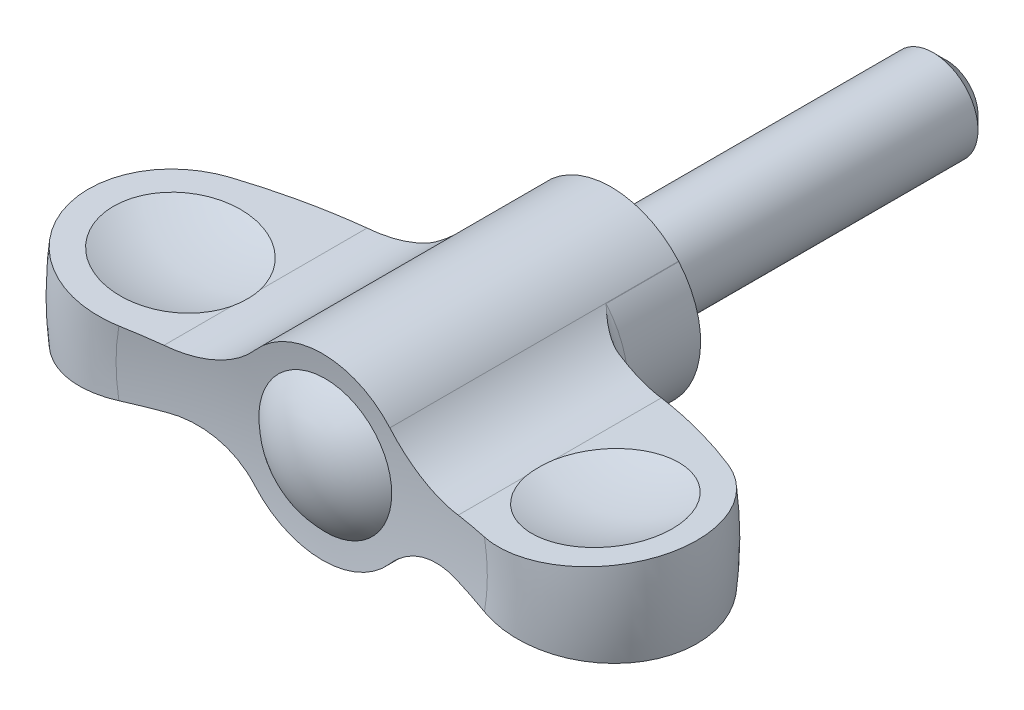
ISO-10303-21;
HEADER;
FILE_DESCRIPTION(('STEP AP214'),'2;1');
FILE_NAME('part.step','',(''),(''),'','','');
FILE_SCHEMA(('AUTOMOTIVE_DESIGN { 1 0 10303 214 1 1 1 1 }'));
ENDSEC;
DATA;
#1=APPLICATION_CONTEXT('core data for automotive mechanical design processes');
#2=APPLICATION_PROTOCOL_DEFINITION('international standard','automotive_design',2000,#1);
#3=PRODUCT_CONTEXT('',#1,'mechanical');
#4=PRODUCT('Part','Part','',(#3));
#5=PRODUCT_RELATED_PRODUCT_CATEGORY('part','',(#4));
#6=PRODUCT_DEFINITION_FORMATION('','',#4);
#7=PRODUCT_DEFINITION_CONTEXT('part definition',#1,'design');
#8=PRODUCT_DEFINITION('design','',#6,#7);
#9=PRODUCT_DEFINITION_SHAPE('','',#8);
#10=(LENGTH_UNIT() NAMED_UNIT(*) SI_UNIT(.MILLI.,.METRE.));
#11=(NAMED_UNIT(*) PLANE_ANGLE_UNIT() SI_UNIT($,.RADIAN.));
#12=(NAMED_UNIT(*) SI_UNIT($,.STERADIAN.) SOLID_ANGLE_UNIT());
#13=UNCERTAINTY_MEASURE_WITH_UNIT(LENGTH_MEASURE(1.E-05),#10,'distance_accuracy_value','');
#14=(GEOMETRIC_REPRESENTATION_CONTEXT(3) GLOBAL_UNCERTAINTY_ASSIGNED_CONTEXT((#13)) GLOBAL_UNIT_ASSIGNED_CONTEXT((#10,
#11,#12)) REPRESENTATION_CONTEXT('',''));
#15=CARTESIAN_POINT('',(0.,0.,0.));
#16=DIRECTION('',(0.,0.,1.));
#17=DIRECTION('',(1.,0.,0.));
#18=AXIS2_PLACEMENT_3D('',#15,#16,#17);
#19=CARTESIAN_POINT('',(0.,0.,6.5));
#20=DIRECTION('',(0.,0.,1.));
#21=DIRECTION('',(0.,-1.,0.));
#22=AXIS2_PLACEMENT_3D('',#19,#20,#21);
#23=TOROIDAL_SURFACE('',#22,9.4,1.40000000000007);
#24=DIRECTION('',(0.,0.,1.));
#25=VECTOR('',#24,1.);
#26=CARTESIAN_POINT('',(6.03890778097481,-5.2470556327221,-30.));
#27=LINE('',#26,#25);
#28=CARTESIAN_POINT('',(6.03890778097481,-5.24705563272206,6.5));
#29=VERTEX_POINT('',#28);
#30=CARTESIAN_POINT('',(6.03890778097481,-5.2470556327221,6.5021200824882));
#31=VERTEX_POINT('',#30);
#32=EDGE_CURVE('E178',#29,#31,#27,.T.);
#33=ORIENTED_EDGE('',*,*,#32,.F.);
#34=CARTESIAN_POINT('',(0.,0.,6.5));
#35=DIRECTION('',(0.,0.,1.));
#36=DIRECTION('',(0.,-1.,0.));
#37=AXIS2_PLACEMENT_3D('',#34,#35,#36);
#38=CIRCLE('',#37,8.);
#39=CARTESIAN_POINT('',(6.0470062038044,5.23772049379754,6.4999999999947));
#40=VERTEX_POINT('',#39);
#41=EDGE_CURVE('E299',#29,#40,#38,.T.);
#42=ORIENTED_EDGE('',*,*,#41,.T.);
#43=CARTESIAN_POINT('',(8.59708199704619,3.29504177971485,7.88661989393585));
#44=CARTESIAN_POINT('',(8.50944178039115,3.33729136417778,7.87729621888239));
#45=CARTESIAN_POINT('',(8.42307614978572,3.38091432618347,7.86348310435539));
#46=CARTESIAN_POINT('',(8.25334791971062,3.47048341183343,7.82827393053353));
#47=CARTESIAN_POINT('',(8.16997966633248,3.51642472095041,7.80689307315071));
#48=CARTESIAN_POINT('',(8.006927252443,3.6100455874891,7.75806975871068));
#49=CARTESIAN_POINT('',(7.92722117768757,3.65771052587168,7.73067131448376));
#50=CARTESIAN_POINT('',(7.77086822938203,3.75487699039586,7.67078020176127));
#51=CARTESIAN_POINT('',(7.69422278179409,3.80437935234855,7.6382851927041));
#52=CARTESIAN_POINT('',(7.51481068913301,3.9245724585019,7.55570149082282));
#53=CARTESIAN_POINT('',(7.41345025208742,3.996030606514,7.50367899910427));
#54=CARTESIAN_POINT('',(7.21620642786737,4.14190058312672,7.39355525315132));
#55=CARTESIAN_POINT('',(7.12032815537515,4.21631506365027,7.33544846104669));
#56=CARTESIAN_POINT('',(6.89765495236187,4.39723051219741,7.19147911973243));
#57=CARTESIAN_POINT('',(6.77323076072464,4.50501816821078,7.10356810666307));
#58=CARTESIAN_POINT('',(6.57394920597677,4.68848676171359,6.95337103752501));
#59=CARTESIAN_POINT('',(6.49659267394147,4.7626588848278,6.89250585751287));
#60=CARTESIAN_POINT('',(6.37240043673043,4.8865809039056,6.79132557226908));
#61=CARTESIAN_POINT('',(6.32451434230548,4.93561192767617,6.75141880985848));
#62=CARTESIAN_POINT('',(6.24744938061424,5.01656740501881,6.68590586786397));
#63=CARTESIAN_POINT('',(6.21784284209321,5.04817964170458,6.66041557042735));
#64=CARTESIAN_POINT('',(6.1701203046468,5.09997024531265,6.61881307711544));
#65=CARTESIAN_POINT('',(6.15183084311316,5.12002285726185,6.60274326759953));
#66=CARTESIAN_POINT('',(6.12231217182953,5.15271930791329,6.57655539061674));
#67=CARTESIAN_POINT('',(6.11100884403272,5.16531979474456,6.56646663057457));
#68=CARTESIAN_POINT('',(6.09275021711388,5.18580384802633,6.549990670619));
#69=CARTESIAN_POINT('',(6.08575717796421,5.19368060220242,6.54363714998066));
#70=CARTESIAN_POINT('',(6.07446460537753,5.20645064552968,6.53319636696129));
#71=CARTESIAN_POINT('',(6.07013806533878,5.21135545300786,6.52915239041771));
#72=CARTESIAN_POINT('',(6.06316395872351,5.21928103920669,6.52242537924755));
#73=CARTESIAN_POINT('',(6.06049083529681,5.22232358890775,6.51979601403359));
#74=CARTESIAN_POINT('',(6.05620285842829,5.22721145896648,6.51533355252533));
#75=CARTESIAN_POINT('',(6.05455913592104,5.22908696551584,6.51356171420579));
#76=CARTESIAN_POINT('',(6.05194270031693,5.23207504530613,6.51046552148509));
#77=CARTESIAN_POINT('',(6.05093886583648,5.23322217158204,6.50920550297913));
#78=CARTESIAN_POINT('',(6.04952852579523,5.23483466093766,6.50714224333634));
#79=CARTESIAN_POINT('',(6.04907130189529,5.23535757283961,6.50641962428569));
#80=CARTESIAN_POINT('',(6.04823146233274,5.23631829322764,6.50488003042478));
#81=CARTESIAN_POINT('',(6.04784824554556,5.23675678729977,6.50406390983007));
#82=CARTESIAN_POINT('',(6.04743475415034,5.2372299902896,6.50282878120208));
#83=CARTESIAN_POINT('',(6.04733123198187,5.23734847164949,6.50246832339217));
#84=CARTESIAN_POINT('',(6.04716301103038,5.23754100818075,6.50172769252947));
#85=CARTESIAN_POINT('',(6.04709815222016,5.23761524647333,6.50134760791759));
#86=CARTESIAN_POINT('',(6.04703697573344,5.23768527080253,6.50077037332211));
#87=CARTESIAN_POINT('',(6.04702259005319,5.23770173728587,6.50057747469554));
#88=CARTESIAN_POINT('',(6.0470060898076,5.23772062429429,6.50018965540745));
#89=CARTESIAN_POINT('',(6.04700402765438,5.23772298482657,6.49999472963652));
#90=CARTESIAN_POINT('',(6.0470084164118,5.23771796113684,6.49979999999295));
#91=B_SPLINE_CURVE_WITH_KNOTS('',3,(#43,#44,#45,#46,#47,#48,#49,#50,#51,#52,#53,#54,#55,#56,#57,
#58,#59,#60,#61,#62,#63,#64,#65,#66,#67,#68,#69,#70,#71,#72,#73,#74,#75,#76,#77,#78,#79,#80,#81,
#82,#83,#84,#85,#86,#87,#88,#89,#90),.UNSPECIFIED.,.F.,.F.,(4,2,2,2,2,2,2,2,2,2,2,2,2,2,2,2,2,2,
2,2,2,2,2,4),(0.,0.292919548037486,0.585253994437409,0.875517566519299,1.16591483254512,
1.56900991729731,1.97247513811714,2.53185645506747,2.90152662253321,3.1394263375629,
3.29018867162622,3.38481100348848,3.44392835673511,3.48083041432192,3.50389909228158,
3.51838177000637,3.52755772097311,3.53347737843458,3.53648190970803,3.53946090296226,
3.54063718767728,3.54180856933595,3.54239014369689,3.5429741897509),.UNSPECIFIED.);
#92=CARTESIAN_POINT('',(8.59520200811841,3.29594858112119,7.88641989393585));
#93=VERTEX_POINT('',#92);
#94=EDGE_CURVE('E445',#93,#40,#91,.T.);
#95=ORIENTED_EDGE('',*,*,#94,.F.);
#96=CARTESIAN_POINT('',(0.,0.,7.88641989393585));
#97=DIRECTION('',(0.,0.,1.));
#98=DIRECTION('',(0.,-1.,0.));
#99=AXIS2_PLACEMENT_3D('',#96,#97,#98);
#100=CIRCLE('',#99,9.20547525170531);
#101=CARTESIAN_POINT('',(8.59545916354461,-3.29527789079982,7.88641989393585));
#102=VERTEX_POINT('',#101);
#103=EDGE_CURVE('E300',#102,#93,#100,.T.);
#104=ORIENTED_EDGE('',*,*,#103,.F.);
#105=CARTESIAN_POINT('',(9.2464198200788,-3.01597169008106,7.86154869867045));
#106=CARTESIAN_POINT('',(9.191703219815,-3.03662617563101,7.87246212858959));
#107=CARTESIAN_POINT('',(9.13683292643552,-3.05803382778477,7.88088984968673));
#108=CARTESIAN_POINT('',(9.0272184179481,-3.10220967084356,7.89317258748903));
#109=CARTESIAN_POINT('',(8.97247413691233,-3.12497578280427,7.89703441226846));
#110=CARTESIAN_POINT('',(8.80995844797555,-3.19470660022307,7.90236716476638));
#111=CARTESIAN_POINT('',(8.70276195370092,-3.24353448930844,7.89779252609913));
#112=CARTESIAN_POINT('',(8.51047394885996,-3.33625869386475,7.87741400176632));
#113=CARTESIAN_POINT('',(8.42481297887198,-3.37951008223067,7.86372857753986));
#114=CARTESIAN_POINT('',(8.25627111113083,-3.46839491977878,7.82888132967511));
#115=CARTESIAN_POINT('',(8.17339149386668,-3.51402944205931,7.80771611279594));
#116=CARTESIAN_POINT('',(7.92832133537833,-3.65460006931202,7.73466741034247));
#117=CARTESIAN_POINT('',(7.77073045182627,-3.75270198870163,7.67337075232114));
#118=CARTESIAN_POINT('',(7.51219223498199,-3.92592329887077,7.55434149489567));
#119=CARTESIAN_POINT('',(7.40810830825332,-3.99942155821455,7.50076399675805));
#120=CARTESIAN_POINT('',(7.20573498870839,-4.14951628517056,7.38724676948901));
#121=CARTESIAN_POINT('',(7.10744753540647,-4.22611377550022,7.32730492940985));
#122=CARTESIAN_POINT('',(6.91648045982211,-4.38209339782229,7.20294133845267));
#123=CARTESIAN_POINT('',(6.82379096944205,-4.46147021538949,7.13852792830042));
#124=CARTESIAN_POINT('',(6.64338510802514,-4.62314447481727,7.00654560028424));
#125=CARTESIAN_POINT('',(6.55566785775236,-4.70544139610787,6.93897724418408));
#126=CARTESIAN_POINT('',(6.43300905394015,-4.82577735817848,6.84059313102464));
#127=CARTESIAN_POINT('',(6.39621820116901,-4.86258512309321,6.8105538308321));
#128=CARTESIAN_POINT('',(6.32347498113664,-4.93679114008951,6.75019039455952));
#129=CARTESIAN_POINT('',(6.28752259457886,-4.97418937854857,6.71986626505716));
#130=CARTESIAN_POINT('',(6.23420044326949,-5.03074553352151,6.67427938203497));
#131=CARTESIAN_POINT('',(6.21653276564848,-5.04966820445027,6.65907163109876));
#132=CARTESIAN_POINT('',(6.18141428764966,-5.08764734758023,6.62856921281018));
#133=CARTESIAN_POINT('',(6.16396349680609,-5.10670382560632,6.61327454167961));
#134=CARTESIAN_POINT('',(6.12918837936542,-5.14505447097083,6.58285648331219));
#135=CARTESIAN_POINT('',(6.11186402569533,-5.16434858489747,6.5677330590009));
#136=CARTESIAN_POINT('',(6.07769243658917,-5.20276831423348,6.53674407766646));
#137=CARTESIAN_POINT('',(6.06084502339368,-5.22189399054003,6.52087880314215));
#138=CARTESIAN_POINT('',(6.04125233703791,-5.24436286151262,6.50407138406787));
#139=CARTESIAN_POINT('',(6.03883132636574,-5.24714312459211,6.5020224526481));
#140=CARTESIAN_POINT('',(6.036402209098,-5.24993655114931,6.5));
#141=B_SPLINE_CURVE_WITH_KNOTS('',3,(#105,#106,#107,#108,#109,#110,#111,#112,#113,#114,#115,
#116,#117,#118,#119,#120,#121,#122,#123,#124,#125,#126,#127,#128,#129,#130,#131,#132,#133,#134,
#135,#136,#137,#138,#139,#140),.UNSPECIFIED.,.F.,.F.,(4,2,2,2,2,2,2,2,2,2,2,2,2,2,2,2,2,4),(0.,
0.178341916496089,0.356417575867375,0.708892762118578,0.999321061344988,1.28988128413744,
1.87442815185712,2.28884312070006,2.7033959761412,3.11719533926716,3.53092130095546,
3.71118323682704,3.89144102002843,3.98151493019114,4.07159278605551,4.16165075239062,
4.25167469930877,4.26432797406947),.UNSPECIFIED.);
#142=EDGE_CURVE('E316',#31,#102,#141,.F.);
#143=ORIENTED_EDGE('',*,*,#142,.F.);
#144=EDGE_LOOP('',(#33,#42,#95,#104,#143));
#145=FACE_BOUND('',#144,.T.);
#146=ADVANCED_FACE('F14',(#145),#23,.F.);
#147=CARTESIAN_POINT('',(7.9999999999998,0.,0.));
#148=DIRECTION('',(0.,0.,-1.));
#149=DIRECTION('',(0.,1.,0.));
#150=AXIS2_PLACEMENT_3D('',#147,#148,#149);
#151=PLANE('',#150);
#152=CARTESIAN_POINT('',(0.,0.,0.));
#153=DIRECTION('',(0.,0.,1.));
#154=DIRECTION('',(0.,-1.,0.));
#155=AXIS2_PLACEMENT_3D('',#152,#153,#154);
#156=CIRCLE('',#155,4.);
#157=CARTESIAN_POINT('',(0.,-4.,0.));
#158=VERTEX_POINT('',#157);
#159=EDGE_CURVE('E475',#158,#158,#156,.T.);
#160=ORIENTED_EDGE('',*,*,#159,.T.);
#161=EDGE_LOOP('',(#160));
#162=FACE_BOUND('',#161,.T.);
#163=CARTESIAN_POINT('',(12.0717114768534,10.5010774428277,0.));
#164=DIRECTION('',(0.,0.,-1.));
#165=DIRECTION('',(0.,1.,0.));
#166=AXIS2_PLACEMENT_3D('',#163,#164,#165);
#167=CIRCLE('',#166,8.);
#168=CARTESIAN_POINT('',(6.0470062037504,5.23772049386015,0.));
#169=VERTEX_POINT('',#168);
#170=CARTESIAN_POINT('',(6.02470527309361,5.26335694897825,0.));
#171=VERTEX_POINT('',#170);
#172=EDGE_CURVE('E454',#169,#171,#167,.T.);
#173=ORIENTED_EDGE('',*,*,#172,.F.);
#174=CARTESIAN_POINT('',(0.,0.,0.));
#175=DIRECTION('',(0.,0.,1.));
#176=DIRECTION('',(0.,-1.,0.));
#177=AXIS2_PLACEMENT_3D('',#174,#175,#176);
#178=CIRCLE('',#177,8.);
#179=CARTESIAN_POINT('',(-6.04700620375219,5.23772049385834,0.));
#180=VERTEX_POINT('',#179);
#181=EDGE_CURVE('E472',#180,#169,#178,.T.);
#182=ORIENTED_EDGE('',*,*,#181,.F.);
#183=CARTESIAN_POINT('',(-12.0717114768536,10.5010774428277,0.));
#184=DIRECTION('',(0.,0.,-1.));
#185=DIRECTION('',(0.,1.,0.));
#186=AXIS2_PLACEMENT_3D('',#183,#184,#185);
#187=CIRCLE('',#186,8.);
#188=CARTESIAN_POINT('',(-6.0247052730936,5.26335694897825,0.));
#189=VERTEX_POINT('',#188);
#190=EDGE_CURVE('E521',#180,#189,#187,.F.);
#191=ORIENTED_EDGE('',*,*,#190,.T.);
#192=EDGE_CURVE('E471',#171,#189,#178,.T.);
#193=ORIENTED_EDGE('',*,*,#192,.F.);
#194=EDGE_LOOP('',(#173,#182,#191,#193));
#195=FACE_BOUND('',#194,.T.);
#196=ADVANCED_FACE('F268',(#162,#195),#151,.T.);
#197=CARTESIAN_POINT('',(0.,0.,32.9780362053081));
#198=DIRECTION('',(0.,0.,1.));
#199=DIRECTION('',(0.,-1.,0.));
#200=AXIS2_PLACEMENT_3D('',#197,#198,#199);
#201=CYLINDRICAL_SURFACE('',#200,8.);
#202=DIRECTION('',(0.,0.,1.));
#203=VECTOR('',#202,1.);
#204=CARTESIAN_POINT('',(-6.0247052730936,5.26335694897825,-30.));
#205=LINE('',#204,#203);
#206=CARTESIAN_POINT('',(-6.0247052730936,5.26335694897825,25.8131362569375));
#207=VERTEX_POINT('',#206);
#208=EDGE_CURVE('E162',#189,#207,#205,.T.);
#209=ORIENTED_EDGE('',*,*,#208,.T.);
#210=CARTESIAN_POINT('',(0.,0.,25.8131362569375));
#211=DIRECTION('',(0.,0.,1.));
#212=DIRECTION('',(0.,-1.,0.));
#213=AXIS2_PLACEMENT_3D('',#210,#211,#212);
#214=CIRCLE('',#213,8.);
#215=CARTESIAN_POINT('',(6.02470527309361,5.26335694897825,25.8131362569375));
#216=VERTEX_POINT('',#215);
#217=EDGE_CURVE('E477',#216,#207,#214,.T.);
#218=ORIENTED_EDGE('',*,*,#217,.F.);
#219=DIRECTION('',(0.,0.,1.));
#220=VECTOR('',#219,1.);
#221=CARTESIAN_POINT('',(6.02470527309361,5.26335694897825,-30.));
#222=LINE('',#221,#220);
#223=EDGE_CURVE('E165',#171,#216,#222,.T.);
#224=ORIENTED_EDGE('',*,*,#223,.F.);
#225=ORIENTED_EDGE('',*,*,#192,.T.);
#226=EDGE_LOOP('',(#209,#218,#224,#225));
#227=FACE_BOUND('',#226,.T.);
#228=ADVANCED_FACE('F275',(#227),#201,.T.);
#229=DIRECTION('',(0.,0.,1.));
#230=VECTOR('',#229,1.);
#231=CARTESIAN_POINT('',(-6.04700620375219,5.23772049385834,3.25));
#232=LINE('',#231,#230);
#233=CARTESIAN_POINT('',(-6.04700620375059,5.23772049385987,6.5));
#234=VERTEX_POINT('',#233);
#235=EDGE_CURVE('E523',#180,#234,#232,.T.);
#236=ORIENTED_EDGE('',*,*,#235,.F.);
#237=ORIENTED_EDGE('',*,*,#181,.T.);
#238=DIRECTION('',(0.,0.,1.));
#239=VECTOR('',#238,1.);
#240=CARTESIAN_POINT('',(6.0470062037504,5.23772049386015,3.25));
#241=LINE('',#240,#239);
#242=EDGE_CURVE('E451',#169,#40,#241,.T.);
#243=ORIENTED_EDGE('',*,*,#242,.T.);
#244=ORIENTED_EDGE('',*,*,#41,.F.);
#245=ORIENTED_EDGE('',*,*,#32,.T.);
#246=CARTESIAN_POINT('',(6.03890778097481,-5.2470556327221,25.8131362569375));
#247=VERTEX_POINT('',#246);
#248=EDGE_CURVE('E175',#31,#247,#27,.T.);
#249=ORIENTED_EDGE('',*,*,#248,.T.);
#250=CARTESIAN_POINT('',(0.,0.,25.8131362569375));
#251=DIRECTION('',(0.,0.,1.));
#252=DIRECTION('',(0.,-1.,0.));
#253=AXIS2_PLACEMENT_3D('',#250,#251,#252);
#254=CIRCLE('',#253,8.);
#255=CARTESIAN_POINT('',(-6.0389077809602,-5.24705563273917,25.8131362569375));
#256=VERTEX_POINT('',#255);
#257=EDGE_CURVE('E304',#256,#247,#254,.T.);
#258=ORIENTED_EDGE('',*,*,#257,.F.);
#259=DIRECTION('',(0.,0.,1.));
#260=VECTOR('',#259,1.);
#261=CARTESIAN_POINT('',(-6.03890778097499,-5.2470556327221,-30.));
#262=LINE('',#261,#260);
#263=CARTESIAN_POINT('',(-6.03890778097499,-5.2470556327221,6.5021200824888));
#264=VERTEX_POINT('',#263);
#265=EDGE_CURVE('E171',#264,#256,#262,.T.);
#266=ORIENTED_EDGE('',*,*,#265,.F.);
#267=CARTESIAN_POINT('',(-6.03890778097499,-5.24705563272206,6.5));
#268=VERTEX_POINT('',#267);
#269=EDGE_CURVE('E174',#268,#264,#262,.T.);
#270=ORIENTED_EDGE('',*,*,#269,.F.);
#271=EDGE_CURVE('E294',#234,#268,#38,.T.);
#272=ORIENTED_EDGE('',*,*,#271,.F.);
#273=EDGE_LOOP('',(#236,#237,#243,#244,#245,#249,#258,#266,#270,#272));
#274=FACE_BOUND('',#273,.T.);
#275=ADVANCED_FACE('F282',(#274),#201,.T.);
#276=ORIENTED_EDGE('',*,*,#271,.T.);
#277=ORIENTED_EDGE('',*,*,#269,.T.);
#278=CARTESIAN_POINT('',(-9.246419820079,-3.01597169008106,7.86154869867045));
#279=CARTESIAN_POINT('',(-9.19170321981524,-3.03662617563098,7.87246212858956));
#280=CARTESIAN_POINT('',(-9.1368329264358,-3.05803382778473,7.88088984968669));
#281=CARTESIAN_POINT('',(-9.02721841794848,-3.10220967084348,7.89317258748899));
#282=CARTESIAN_POINT('',(-8.97247413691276,-3.12497578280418,7.89703441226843));
#283=CARTESIAN_POINT('',(-8.80995844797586,-3.19470660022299,7.9023671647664));
#284=CARTESIAN_POINT('',(-8.70276195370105,-3.24353448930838,7.89779252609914));
#285=CARTESIAN_POINT('',(-8.51047394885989,-3.33625869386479,7.87741400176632));
#286=CARTESIAN_POINT('',(-8.42481297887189,-3.37951008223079,7.86372857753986));
#287=CARTESIAN_POINT('',(-8.25627111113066,-3.46839491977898,7.82888132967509));
#288=CARTESIAN_POINT('',(-8.17339149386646,-3.51402944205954,7.80771611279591));
#289=CARTESIAN_POINT('',(-7.92832133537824,-3.65460006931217,7.73466741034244));
#290=CARTESIAN_POINT('',(-7.77073045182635,-3.75270198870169,7.67337075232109));
#291=CARTESIAN_POINT('',(-7.51219223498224,-3.92592329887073,7.55434149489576));
#292=CARTESIAN_POINT('',(-7.40810830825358,-3.99942155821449,7.50076399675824));
#293=CARTESIAN_POINT('',(-7.20573498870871,-4.14951628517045,7.38724676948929));
#294=CARTESIAN_POINT('',(-7.10744753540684,-4.22611377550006,7.32730492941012));
#295=CARTESIAN_POINT('',(-6.91648045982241,-4.38209339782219,7.20294133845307));
#296=CARTESIAN_POINT('',(-6.82379096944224,-4.46147021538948,7.13852792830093));
#297=CARTESIAN_POINT('',(-6.64338510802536,-4.62314447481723,7.00654560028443));
#298=CARTESIAN_POINT('',(-6.5556678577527,-4.7054413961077,6.93897724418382));
#299=CARTESIAN_POINT('',(-6.43300905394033,-4.82577735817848,6.84059313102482));
#300=CARTESIAN_POINT('',(-6.39621820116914,-4.86258512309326,6.81055383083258));
#301=CARTESIAN_POINT('',(-6.3234749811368,-4.93679114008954,6.75019039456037));
#302=CARTESIAN_POINT('',(-6.28752259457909,-4.97418937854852,6.71986626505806));
#303=CARTESIAN_POINT('',(-6.23420044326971,-5.03074553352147,6.6742793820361));
#304=CARTESIAN_POINT('',(-6.21653276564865,-5.04966820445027,6.65907163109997));
#305=CARTESIAN_POINT('',(-6.18141428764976,-5.08764734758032,6.62856921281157));
#306=CARTESIAN_POINT('',(-6.16396349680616,-5.10670382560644,6.61327454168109));
#307=CARTESIAN_POINT('',(-6.12918837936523,-5.14505447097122,6.58285648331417));
#308=CARTESIAN_POINT('',(-6.11186402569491,-5.1643485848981,6.56773305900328));
#309=CARTESIAN_POINT('',(-6.07769243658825,-5.20276831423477,6.53674407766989));
#310=CARTESIAN_POINT('',(-6.06084502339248,-5.22189399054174,6.52087880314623));
#311=CARTESIAN_POINT('',(-6.04125233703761,-5.24436286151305,6.50407138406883));
#312=CARTESIAN_POINT('',(-6.03883132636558,-5.24714312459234,6.50202245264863));
#313=CARTESIAN_POINT('',(-6.036402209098,-5.2499365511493,6.5));
#314=B_SPLINE_CURVE_WITH_KNOTS('',3,(#278,#279,#280,#281,#282,#283,#284,#285,#286,#287,#288,
#289,#290,#291,#292,#293,#294,#295,#296,#297,#298,#299,#300,#301,#302,#303,#304,#305,#306,#307,
#308,#309,#310,#311,#312,#313),.UNSPECIFIED.,.F.,.F.,(4,2,2,2,2,2,2,2,2,2,2,2,2,2,2,2,2,4),(0.,
0.178341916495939,0.356417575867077,0.708892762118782,0.999321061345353,1.28988128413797,
1.8744281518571,2.28884312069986,2.70339597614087,3.11719533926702,3.53092130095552,
3.71118323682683,3.89144102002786,3.98151493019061,4.07159278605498,4.16165075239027,
4.25167469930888,4.2643279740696),.UNSPECIFIED.);
#315=CARTESIAN_POINT('',(-8.59545916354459,-3.29527789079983,7.88641989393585));
#316=VERTEX_POINT('',#315);
#317=EDGE_CURVE('E311',#264,#316,#314,.F.);
#318=ORIENTED_EDGE('',*,*,#317,.T.);
#319=CARTESIAN_POINT('',(-8.5952020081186,3.29594858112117,7.88641989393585));
#320=VERTEX_POINT('',#319);
#321=EDGE_CURVE('E467',#320,#316,#100,.T.);
#322=ORIENTED_EDGE('',*,*,#321,.F.);
#323=CARTESIAN_POINT('',(-8.59708199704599,3.29504177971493,7.88661989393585));
#324=CARTESIAN_POINT('',(-8.50944178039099,3.33729136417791,7.87729621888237));
#325=CARTESIAN_POINT('',(-8.42307614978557,3.38091432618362,7.86348310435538));
#326=CARTESIAN_POINT('',(-8.25334791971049,3.47048341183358,7.82827393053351));
#327=CARTESIAN_POINT('',(-8.16997966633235,3.51642472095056,7.80689307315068));
#328=CARTESIAN_POINT('',(-8.00692725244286,3.61004558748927,7.75806975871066));
#329=CARTESIAN_POINT('',(-7.92722117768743,3.65771052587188,7.73067131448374));
#330=CARTESIAN_POINT('',(-7.77086822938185,3.75487699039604,7.67078020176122));
#331=CARTESIAN_POINT('',(-7.69422278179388,3.80437935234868,7.63828519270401));
#332=CARTESIAN_POINT('',(-7.51481068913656,3.92457245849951,7.55570149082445));
#333=CARTESIAN_POINT('',(-7.41345025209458,3.99603060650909,7.50367899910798));
#334=CARTESIAN_POINT('',(-7.21620642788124,4.14190058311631,7.39355525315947));
#335=CARTESIAN_POINT('',(-7.12032815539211,4.2163150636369,7.33544846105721));
#336=CARTESIAN_POINT('',(-6.8976549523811,4.39723051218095,7.19147911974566));
#337=CARTESIAN_POINT('',(-6.77323076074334,4.50501816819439,7.1035681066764));
#338=CARTESIAN_POINT('',(-6.57394920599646,4.68848676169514,6.95337103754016));
#339=CARTESIAN_POINT('',(-6.49659267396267,4.76265888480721,6.89250585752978));
#340=CARTESIAN_POINT('',(-6.37240043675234,4.88658090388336,6.7913255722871));
#341=CARTESIAN_POINT('',(-6.32451434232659,4.93561192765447,6.7514188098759));
#342=CARTESIAN_POINT('',(-6.24744938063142,5.01656740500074,6.68590586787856));
#343=CARTESIAN_POINT('',(-6.21784284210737,5.04817964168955,6.66041557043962));
#344=CARTESIAN_POINT('',(-6.17012030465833,5.09997024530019,6.61881307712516));
#345=CARTESIAN_POINT('',(-6.1518308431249,5.12002285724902,6.60274326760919));
#346=CARTESIAN_POINT('',(-6.12231217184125,5.15271930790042,6.57655539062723));
#347=CARTESIAN_POINT('',(-6.11100884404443,5.16531979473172,6.56646663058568));
#348=CARTESIAN_POINT('',(-6.09275021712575,5.1858038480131,6.54999067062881));
#349=CARTESIAN_POINT('',(-6.08575717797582,5.19368060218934,6.54363714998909));
#350=CARTESIAN_POINT('',(-6.07446460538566,5.20645064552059,6.53319636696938));
#351=CARTESIAN_POINT('',(-6.07013806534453,5.21135545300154,6.52915239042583));
#352=CARTESIAN_POINT('',(-6.06316395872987,5.21928103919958,6.52242537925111));
#353=CARTESIAN_POINT('',(-6.06049083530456,5.22232358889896,6.51979601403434));
#354=CARTESIAN_POINT('',(-6.05620285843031,5.22721145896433,6.51533355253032));
#355=CARTESIAN_POINT('',(-6.05455913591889,5.22908696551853,6.51356171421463));
#356=CARTESIAN_POINT('',(-6.05194270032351,5.23207504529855,6.51046552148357));
#357=CARTESIAN_POINT('',(-6.05093886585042,5.23322217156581,6.50920550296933));
#358=CARTESIAN_POINT('',(-6.04952852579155,5.23483466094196,6.5071422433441));
#359=CARTESIAN_POINT('',(-6.0490713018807,5.23535757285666,6.50641962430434));
#360=CARTESIAN_POINT('',(-6.04823146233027,5.23631829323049,6.50488003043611));
#361=CARTESIAN_POINT('',(-6.04784824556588,5.23675678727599,6.50406390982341));
#362=CARTESIAN_POINT('',(-6.04743475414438,5.23722999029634,6.50282878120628));
#363=CARTESIAN_POINT('',(-6.04733123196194,5.23734847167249,6.50246832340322));
#364=CARTESIAN_POINT('',(-6.04716301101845,5.23754100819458,6.50172769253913));
#365=CARTESIAN_POINT('',(-6.04709815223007,5.23761524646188,6.50134760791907));
#366=CARTESIAN_POINT('',(-6.04703697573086,5.23768527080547,6.5007703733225));
#367=CARTESIAN_POINT('',(-6.04702259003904,5.23770173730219,6.50057747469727));
#368=CARTESIAN_POINT('',(-6.04700608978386,5.23772062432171,6.50018965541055));
#369=CARTESIAN_POINT('',(-6.04700402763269,5.23772298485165,6.49999472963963));
#370=CARTESIAN_POINT('',(-6.0470084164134,5.23771796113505,6.49979999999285));
#371=B_SPLINE_CURVE_WITH_KNOTS('',3,(#323,#324,#325,#326,#327,#328,#329,#330,#331,#332,#333,
#334,#335,#336,#337,#338,#339,#340,#341,#342,#343,#344,#345,#346,#347,#348,#349,#350,#351,#352,
#353,#354,#355,#356,#357,#358,#359,#360,#361,#362,#363,#364,#365,#366,#367,#368,#369,#370),
.UNSPECIFIED.,.F.,.F.,(4,2,2,2,2,2,2,2,2,2,2,2,2,2,2,2,2,2,2,2,2,2,2,4),(0.,0.292919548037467,
0.58525399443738,0.875517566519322,1.16591483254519,1.56900991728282,1.97247513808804,
2.53185645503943,2.90152662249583,3.13942633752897,3.29018867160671,3.38481100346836,
3.44392835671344,3.48083041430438,3.503899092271,3.51838176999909,3.52755772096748,
3.53347737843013,3.53648190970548,3.53946090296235,3.54063718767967,3.54180856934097,
3.54239014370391,3.54297418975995),.UNSPECIFIED.);
#372=EDGE_CURVE('E194',#320,#234,#371,.T.);
#373=ORIENTED_EDGE('',*,*,#372,.T.);
#374=EDGE_LOOP('',(#276,#277,#318,#322,#373));
#375=FACE_BOUND('',#374,.T.);
#376=ADVANCED_FACE('F270',(#375),#23,.F.);
#377=CARTESIAN_POINT('',(0.,0.,55.408674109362));
#378=DIRECTION('',(0.,0.,1.));
#379=DIRECTION('',(0.,-1.,0.));
#380=AXIS2_PLACEMENT_3D('',#377,#378,#379);
#381=DEGENERATE_TOROIDAL_SURFACE('',#380,2.53775894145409,47.9877389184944,.T.);
#382=ORIENTED_EDGE('',*,*,#103,.T.);
#383=CARTESIAN_POINT('',(5.40789714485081,6.07461400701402,7.74825077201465));
#384=CARTESIAN_POINT('',(5.5291773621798,5.89198502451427,7.7417150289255));
#385=CARTESIAN_POINT('',(5.65803975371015,5.71432205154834,7.7372582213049));
#386=CARTESIAN_POINT('',(5.92992964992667,5.37014226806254,7.7324895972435));
#387=CARTESIAN_POINT('',(6.07295642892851,5.2036248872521,7.73217756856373));
#388=CARTESIAN_POINT('',(6.37210580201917,4.88302009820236,7.73568398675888));
#389=CARTESIAN_POINT('',(6.52822111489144,4.72892587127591,7.73950015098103));
#390=CARTESIAN_POINT('',(6.85248447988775,4.43414479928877,7.75130368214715));
#391=CARTESIAN_POINT('',(7.02063240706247,4.29345781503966,7.75929100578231));
#392=CARTESIAN_POINT('',(7.36839276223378,4.02596374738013,7.77954568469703));
#393=CARTESIAN_POINT('',(7.54804576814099,3.89921061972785,7.79182895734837));
#394=CARTESIAN_POINT('',(7.9169239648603,3.66105266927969,7.82074605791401));
#395=CARTESIAN_POINT('',(8.10614934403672,3.54964814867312,7.83737997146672));
#396=CARTESIAN_POINT('',(8.49266533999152,3.34297499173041,7.87504105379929));
#397=CARTESIAN_POINT('',(8.68995161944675,3.24769781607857,7.89606588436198));
#398=CARTESIAN_POINT('',(9.09122637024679,3.07379499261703,7.94252339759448));
#399=CARTESIAN_POINT('',(9.29521479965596,2.99516924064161,7.96795605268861));
#400=CARTESIAN_POINT('',(9.70845663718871,2.854990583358,8.02319155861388));
#401=CARTESIAN_POINT('',(9.91771139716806,2.79344211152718,8.05299554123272));
#402=CARTESIAN_POINT('',(10.3400150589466,2.68771529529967,8.11688005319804));
#403=CARTESIAN_POINT('',(10.5530655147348,2.64354424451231,8.15096237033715));
#404=CARTESIAN_POINT('',(10.9815499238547,2.57272696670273,8.22326754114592));
#405=CARTESIAN_POINT('',(11.1969857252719,2.54609545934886,8.2614938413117));
#406=CARTESIAN_POINT('',(11.6284903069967,2.51043256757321,8.34184151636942));
#407=CARTESIAN_POINT('',(11.844558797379,2.50139409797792,8.38396131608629));
#408=CARTESIAN_POINT('',(12.2806577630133,2.50077046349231,8.47281848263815));
#409=CARTESIAN_POINT('',(12.5006723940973,2.50956853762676,8.51963625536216));
#410=CARTESIAN_POINT('',(12.9384709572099,2.54513800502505,8.6167995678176));
#411=CARTESIAN_POINT('',(13.156254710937,2.57191082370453,8.66714538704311));
#412=CARTESIAN_POINT('',(13.5879515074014,2.6430363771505,8.77098851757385));
#413=CARTESIAN_POINT('',(13.8018678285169,2.68737341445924,8.82448297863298));
#414=CARTESIAN_POINT('',(14.2246542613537,2.79313397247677,8.93430204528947));
#415=CARTESIAN_POINT('',(14.4335251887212,2.85455471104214,8.99062618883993));
#416=CARTESIAN_POINT('',(14.6392212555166,2.92427775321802,9.04819298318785));
#417=B_SPLINE_CURVE_WITH_KNOTS('',3,(#383,#384,#385,#386,#387,#388,#389,#390,#391,#392,#393,
#394,#395,#396,#397,#398,#399,#400,#401,#402,#403,#404,#405,#406,#407,#408,#409,#410,#411,#412,
#413,#414,#415,#416),.UNSPECIFIED.,.F.,.F.,(4,2,2,2,2,2,2,2,2,2,2,2,2,2,2,2,4),(0.,
0.657784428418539,1.31553517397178,1.9729224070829,2.63030281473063,3.2901452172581,
3.95000060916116,4.60950551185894,5.26900628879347,5.92867812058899,6.58862653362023,
7.24912809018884,7.90936359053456,8.58393530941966,9.25856052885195,9.93258417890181,
10.6064981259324),.UNSPECIFIED.);
#418=CARTESIAN_POINT('',(13.1528156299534,2.57446317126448,8.66701618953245));
#419=VERTEX_POINT('',#418);
#420=EDGE_CURVE('E438',#93,#419,#417,.T.);
#421=ORIENTED_EDGE('',*,*,#420,.T.);
#422=CARTESIAN_POINT('',(13.1526156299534,2.57444288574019,8.66696966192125));
#423=CARTESIAN_POINT('',(13.9370340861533,2.65400458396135,8.84943351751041));
#424=CARTESIAN_POINT('',(14.7168563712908,2.73310010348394,9.05185397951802));
#425=CARTESIAN_POINT('',(16.2633623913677,2.88995853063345,9.49546553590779));
#426=CARTESIAN_POINT('',(17.0300745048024,2.96772431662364,9.73655668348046));
#427=CARTESIAN_POINT('',(18.5504261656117,3.12192996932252,10.2573018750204));
#428=CARTESIAN_POINT('',(19.3040656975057,3.19836983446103,10.5369559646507));
#429=CARTESIAN_POINT('',(20.7982632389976,3.34992273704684,11.134858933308));
#430=CARTESIAN_POINT('',(21.5387829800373,3.4250318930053,11.4532044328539));
#431=CARTESIAN_POINT('',(22.2708092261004,3.49927957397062,11.7901956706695));
#432=B_SPLINE_CURVE_WITH_KNOTS('',3,(#422,#423,#424,#425,#426,#427,#428,#429,#430,#431),
.UNSPECIFIED.,.F.,.F.,(4,2,2,2,4),(0.,2.42758220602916,4.84898838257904,7.27039742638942,
9.69798251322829),.UNSPECIFIED.);
#433=CARTESIAN_POINT('',(22.2703747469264,3.49923550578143,11.7899956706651));
#434=VERTEX_POINT('',#433);
#435=EDGE_CURVE('E431',#419,#434,#432,.T.);
#436=ORIENTED_EDGE('',*,*,#435,.T.);
#437=CARTESIAN_POINT('',(0.,0.,11.7899956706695));
#438=DIRECTION('',(0.,0.,1.));
#439=DIRECTION('',(0.,-1.,0.));
#440=AXIS2_PLACEMENT_3D('',#437,#438,#439);
#441=CIRCLE('',#440,22.5436075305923);
#442=CARTESIAN_POINT('',(22.2706216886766,-3.49766351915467,11.7899956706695));
#443=VERTEX_POINT('',#442);
#444=EDGE_CURVE('E464',#443,#434,#441,.T.);
#445=ORIENTED_EDGE('',*,*,#444,.F.);
#446=CARTESIAN_POINT('',(12.9962083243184,-2.55398166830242,8.63065853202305));
#447=CARTESIAN_POINT('',(13.7943446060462,-2.63519292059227,8.81347846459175));
#448=CARTESIAN_POINT('',(14.5877985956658,-2.71592774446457,9.01694513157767));
#449=CARTESIAN_POINT('',(16.1611919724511,-2.87602226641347,9.46398142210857));
#450=CARTESIAN_POINT('',(16.9411614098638,-2.95538502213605,9.70744418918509));
#451=CARTESIAN_POINT('',(18.4876557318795,-3.11274253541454,10.2342505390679));
#452=CARTESIAN_POINT('',(19.2541805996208,-3.19073729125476,10.5175941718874));
#453=CARTESIAN_POINT('',(20.7737763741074,-3.34535784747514,11.1241962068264));
#454=CARTESIAN_POINT('',(21.5268064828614,-3.42197949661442,11.4475578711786));
#455=CARTESIAN_POINT('',(22.271056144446,-3.4977077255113,11.7901956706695));
#456=B_SPLINE_CURVE_WITH_KNOTS('',3,(#446,#447,#448,#449,#450,#451,#452,#453,#454,#455),
.UNSPECIFIED.,.F.,.F.,(4,2,2,2,4),(0.,2.46819948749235,4.92990890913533,7.3916214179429,
9.85982400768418),.UNSPECIFIED.);
#457=CARTESIAN_POINT('',(12.9964083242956,-2.5540020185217,8.63070434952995));
#458=VERTEX_POINT('',#457);
#459=EDGE_CURVE('E414',#458,#443,#456,.T.);
#460=ORIENTED_EDGE('',*,*,#459,.F.);
#461=CARTESIAN_POINT('',(5.40816196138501,-6.0746786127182,7.7482771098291));
#462=CARTESIAN_POINT('',(5.52938177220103,-5.89205626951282,7.74173743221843));
#463=CARTESIAN_POINT('',(5.65818351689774,-5.7143974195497,7.73727619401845));
#464=CARTESIAN_POINT('',(5.92995209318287,-5.37022086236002,7.73249766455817));
#465=CARTESIAN_POINT('',(6.07291819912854,-5.20370258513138,7.7321801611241));
#466=CARTESIAN_POINT('',(6.37194671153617,-4.88309096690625,7.73567453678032));
#467=CARTESIAN_POINT('',(6.52800183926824,-4.72899081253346,7.73948413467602));
#468=CARTESIAN_POINT('',(6.85214571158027,-4.43419295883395,7.75127335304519));
#469=CARTESIAN_POINT('',(7.02023433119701,-4.29349512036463,7.75925293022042));
#470=CARTESIAN_POINT('',(7.36787685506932,-4.02597472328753,7.77949081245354));
#471=CARTESIAN_POINT('',(7.54747132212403,-3.89920607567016,7.79176502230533));
#472=CARTESIAN_POINT('',(7.91623418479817,-3.66101233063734,7.82066267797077));
#473=CARTESIAN_POINT('',(8.10540276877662,-3.54958753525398,7.83728620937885));
#474=CARTESIAN_POINT('',(8.49180737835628,-3.34286928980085,7.87492522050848));
#475=CARTESIAN_POINT('',(8.68903906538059,-3.24756730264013,7.89593836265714));
#476=CARTESIAN_POINT('',(9.09020720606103,-3.0736105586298,7.94237123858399));
#477=CARTESIAN_POINT('',(9.29414361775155,-2.99495569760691,7.96779094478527));
#478=CARTESIAN_POINT('',(9.70728411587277,-2.85471488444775,8.02299934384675));
#479=CARTESIAN_POINT('',(9.91648954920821,-2.79313334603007,8.05278916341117));
#480=CARTESIAN_POINT('',(10.3386977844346,-2.68733665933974,8.11664426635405));
#481=CARTESIAN_POINT('',(10.5517021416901,-2.6431288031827,8.15071133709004));
#482=CARTESIAN_POINT('',(10.980097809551,-2.57223450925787,8.22298504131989));
#483=CARTESIAN_POINT('',(11.1954909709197,-2.5455627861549,8.26119511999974));
#484=CARTESIAN_POINT('',(11.6269140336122,-2.50981645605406,8.34150952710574));
#485=CARTESIAN_POINT('',(11.8429436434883,-2.5007347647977,8.38361228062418));
#486=CARTESIAN_POINT('',(12.2789655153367,-2.50002106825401,8.4724337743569));
#487=CARTESIAN_POINT('',(12.4989420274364,-2.50877204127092,8.51923286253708));
#488=CARTESIAN_POINT('',(12.9366686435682,-2.5442445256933,8.61635812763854));
#489=CARTESIAN_POINT('',(13.1544185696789,-2.57096746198,8.66668458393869));
#490=CARTESIAN_POINT('',(13.5860522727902,-2.6419909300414,8.77048849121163));
#491=CARTESIAN_POINT('',(13.7999393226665,-2.68627577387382,8.82396309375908));
#492=CARTESIAN_POINT('',(14.2226717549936,-2.79192997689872,8.93374204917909));
#493=CARTESIAN_POINT('',(14.4315179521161,-2.85329655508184,8.99004594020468));
#494=CARTESIAN_POINT('',(14.6371915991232,-2.92296463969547,9.04759234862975));
#495=B_SPLINE_CURVE_WITH_KNOTS('',3,(#461,#462,#463,#464,#465,#466,#467,#468,#469,#470,#471,
#472,#473,#474,#475,#476,#477,#478,#479,#480,#481,#482,#483,#484,#485,#486,#487,#488,#489,#490,
#491,#492,#493,#494),.UNSPECIFIED.,.F.,.F.,(4,2,2,2,2,2,2,2,2,2,2,2,2,2,2,2,4),(0.,
0.657668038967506,1.31530240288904,1.97257345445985,2.62983768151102,3.28956225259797,
3.9492998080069,4.60868692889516,5.26806992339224,5.92762322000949,6.58745305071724,
7.24783584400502,7.90795261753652,8.58239553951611,9.25689194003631,9.93078716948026,
10.6045727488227),.UNSPECIFIED.);
#496=EDGE_CURVE('E314',#458,#102,#495,.F.);
#497=ORIENTED_EDGE('',*,*,#496,.T.);
#498=EDGE_LOOP('',(#382,#421,#436,#445,#460,#497));
#499=FACE_BOUND('',#498,.T.);
#500=ADVANCED_FACE('F281',(#499),#381,.T.);
#501=CARTESIAN_POINT('',(0.,0.,19.5161101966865));
#502=DIRECTION('',(0.,0.,1.));
#503=DIRECTION('',(0.,-1.,0.));
#504=AXIS2_PLACEMENT_3D('',#501,#502,#503);
#505=TOROIDAL_SURFACE('',#504,19.,8.5);
#506=CARTESIAN_POINT('',(0.,0.,27.6698599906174));
#507=DIRECTION('',(0.,0.,1.));
#508=DIRECTION('',(0.,-1.,0.));
#509=AXIS2_PLACEMENT_3D('',#506,#507,#508);
#510=CIRCLE('',#509,16.5986744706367);
#511=CARTESIAN_POINT('',(16.3443249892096,-2.89465625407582,27.6698599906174));
#512=VERTEX_POINT('',#511);
#513=CARTESIAN_POINT('',(16.3437132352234,2.89810832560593,27.6698599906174));
#514=VERTEX_POINT('',#513);
#515=EDGE_CURVE('E460',#512,#514,#510,.T.);
#516=ORIENTED_EDGE('',*,*,#515,.F.);
#517=CARTESIAN_POINT('',(22.2701871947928,-3.49761930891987,11.7897956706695));
#518=CARTESIAN_POINT('',(22.4865890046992,-3.51963843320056,11.8893708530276));
#519=CARTESIAN_POINT('',(22.6987916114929,-3.54123028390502,11.9981566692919));
#520=CARTESIAN_POINT('',(23.1133331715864,-3.5834103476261,12.2332797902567));
#521=CARTESIAN_POINT('',(23.3156725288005,-3.60399860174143,12.359616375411));
#522=CARTESIAN_POINT('',(23.7089103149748,-3.64401098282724,12.6288905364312));
#523=CARTESIAN_POINT('',(23.8998162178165,-3.66343587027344,12.771817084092));
#524=CARTESIAN_POINT('',(24.2689734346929,-3.70099802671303,13.0733193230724));
#525=CARTESIAN_POINT('',(24.4472249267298,-3.71913531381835,13.2318947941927));
#526=CARTESIAN_POINT('',(24.7898897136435,-3.75400183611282,13.5636589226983));
#527=CARTESIAN_POINT('',(24.9542960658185,-3.77073036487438,13.7368548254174));
#528=CARTESIAN_POINT('',(25.2679995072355,-3.80265003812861,14.0965647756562));
#529=CARTESIAN_POINT('',(25.4172963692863,-3.81784115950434,14.2830790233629));
#530=CARTESIAN_POINT('',(25.6996801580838,-3.84657402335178,14.6680564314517));
#531=CARTESIAN_POINT('',(25.8327705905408,-3.86011612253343,14.8665169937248));
#532=CARTESIAN_POINT('',(26.0818270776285,-3.88545789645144,15.2740114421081));
#533=CARTESIAN_POINT('',(26.1977932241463,-3.89725758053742,15.4830452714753));
#534=CARTESIAN_POINT('',(26.4116662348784,-3.91901939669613,15.9099873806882));
#535=CARTESIAN_POINT('',(26.5095909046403,-3.92898334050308,16.1278866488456));
#536=CARTESIAN_POINT('',(26.6868542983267,-3.9470200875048,16.5712819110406));
#537=CARTESIAN_POINT('',(26.7661865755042,-3.95509223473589,16.7967805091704));
#538=CARTESIAN_POINT('',(26.9056523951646,-3.96928303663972,17.2536913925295));
#539=CARTESIAN_POINT('',(26.9657864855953,-3.97540174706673,17.4851035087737));
#540=CARTESIAN_POINT('',(27.0664298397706,-3.98564232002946,17.9522037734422));
#541=CARTESIAN_POINT('',(27.1069388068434,-3.98976415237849,18.1878919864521));
#542=CARTESIAN_POINT('',(27.1680180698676,-3.99597903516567,18.6616856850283));
#543=CARTESIAN_POINT('',(27.1886032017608,-3.99807359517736,18.8997892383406));
#544=CARTESIAN_POINT('',(27.2097404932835,-4.00022433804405,19.3768982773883));
#545=CARTESIAN_POINT('',(27.2102922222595,-4.00028047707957,19.6159037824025));
#546=CARTESIAN_POINT('',(27.1913600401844,-3.99835410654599,20.0930519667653));
#547=CARTESIAN_POINT('',(27.1718811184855,-3.99637210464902,20.331194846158));
#548=CARTESIAN_POINT('',(27.1130241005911,-3.99038333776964,20.8050668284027));
#549=CARTESIAN_POINT('',(27.0736391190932,-3.98637587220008,21.0407950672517));
#550=CARTESIAN_POINT('',(26.9752654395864,-3.97636624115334,21.5079930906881));
#551=CARTESIAN_POINT('',(26.9162837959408,-3.97036479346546,21.739464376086));
#552=CARTESIAN_POINT('',(26.7791326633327,-3.95640951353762,22.1965957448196));
#553=CARTESIAN_POINT('',(26.7009627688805,-3.94845564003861,22.4222557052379));
#554=CARTESIAN_POINT('',(26.5259936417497,-3.93065233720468,22.8661561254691));
#555=CARTESIAN_POINT('',(26.4291944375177,-3.92080291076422,23.0843965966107));
#556=CARTESIAN_POINT('',(26.2176548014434,-3.89927851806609,23.5119136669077));
#557=CARTESIAN_POINT('',(26.1029139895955,-3.88760351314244,23.7211900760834));
#558=CARTESIAN_POINT('',(25.8562793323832,-3.86250816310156,24.129341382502));
#559=CARTESIAN_POINT('',(25.7243811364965,-3.84908737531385,24.328213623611));
#560=CARTESIAN_POINT('',(25.4443947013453,-3.82059844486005,24.7140892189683));
#561=CARTESIAN_POINT('',(25.2963064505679,-3.8055303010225,24.9010925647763));
#562=CARTESIAN_POINT('',(24.9849941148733,-3.77385392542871,25.2619068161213));
#563=CARTESIAN_POINT('',(24.8217699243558,-3.75724568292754,25.4357176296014));
#564=CARTESIAN_POINT('',(24.4813524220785,-3.72260782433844,25.7689123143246));
#565=CARTESIAN_POINT('',(24.3041593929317,-3.70457823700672,25.9282964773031));
#566=CARTESIAN_POINT('',(23.9369192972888,-3.6672111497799,26.2316340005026));
#567=CARTESIAN_POINT('',(23.746862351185,-3.64787264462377,26.3755752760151));
#568=CARTESIAN_POINT('',(23.3553745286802,-3.60803832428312,26.6468659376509));
#569=CARTESIAN_POINT('',(23.1539438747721,-3.58754253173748,26.7742156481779));
#570=CARTESIAN_POINT('',(22.7410978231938,-3.5455349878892,27.0114526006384));
#571=CARTESIAN_POINT('',(22.5296804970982,-3.52402304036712,27.1213364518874));
#572=CARTESIAN_POINT('',(22.0984744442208,-3.48014734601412,27.3228052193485));
#573=CARTESIAN_POINT('',(21.8786886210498,-3.45778389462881,27.4143964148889));
#574=CARTESIAN_POINT('',(21.431905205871,-3.41232318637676,27.5788085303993));
#575=CARTESIAN_POINT('',(21.20489740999,-3.38922489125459,27.6516014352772));
#576=CARTESIAN_POINT('',(20.7455990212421,-3.34249077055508,27.7777299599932));
#577=CARTESIAN_POINT('',(20.5133085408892,-3.31885495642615,27.8310659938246));
#578=CARTESIAN_POINT('',(20.0450990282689,-3.27121411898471,27.9179123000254));
#579=CARTESIAN_POINT('',(19.8091801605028,-3.24720911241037,27.9514234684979));
#580=CARTESIAN_POINT('',(19.3353786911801,-3.19899928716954,27.998395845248));
#581=CARTESIAN_POINT('',(19.0974961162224,-3.17479447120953,28.0118573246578));
#582=CARTESIAN_POINT('',(18.6210318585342,-3.12631370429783,28.0186515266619));
#583=CARTESIAN_POINT('',(18.3824496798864,-3.10203770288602,28.0119491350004));
#584=CARTESIAN_POINT('',(17.9067737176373,-3.05363714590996,27.9784021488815));
#585=CARTESIAN_POINT('',(17.6696794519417,-3.02951254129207,27.9515644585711));
#586=CARTESIAN_POINT('',(17.1984347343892,-2.98156286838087,27.8779318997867));
#587=CARTESIAN_POINT('',(16.9642861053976,-2.95773798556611,27.8311252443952));
#588=CARTESIAN_POINT('',(16.500740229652,-2.91057167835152,27.7178937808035));
#589=CARTESIAN_POINT('',(16.2713428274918,-2.88723023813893,27.6514696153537));
#590=CARTESIAN_POINT('',(15.8183308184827,-2.84113576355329,27.4992830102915));
#591=CARTESIAN_POINT('',(15.5947326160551,-2.81838439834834,27.4134712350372));
#592=CARTESIAN_POINT('',(15.155526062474,-2.77369464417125,27.2232203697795));
#593=CARTESIAN_POINT('',(14.9399175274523,-2.75175623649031,27.1187817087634));
#594=CARTESIAN_POINT('',(14.5185439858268,-2.70888101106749,26.8921972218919));
#595=CARTESIAN_POINT('',(14.3127646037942,-2.68794273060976,26.7700783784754));
#596=CARTESIAN_POINT('',(13.9122402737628,-2.64718893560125,26.5089238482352));
#597=CARTESIAN_POINT('',(13.7174893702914,-2.62737281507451,26.3698974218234));
#598=CARTESIAN_POINT('',(13.4370604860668,-2.59883886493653,26.1513001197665));
#599=CARTESIAN_POINT('',(13.3466503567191,-2.58963953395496,26.077788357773));
#600=CARTESIAN_POINT('',(13.1690334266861,-2.57156681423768,25.9272071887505));
#601=CARTESIAN_POINT('',(13.081822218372,-2.56269297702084,25.8501430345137));
#602=CARTESIAN_POINT('',(12.9962083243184,-2.55398166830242,25.7713054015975));
#603=B_SPLINE_CURVE_WITH_KNOTS('',3,(#517,#518,#519,#520,#521,#522,#523,#524,#525,#526,#527,
#528,#529,#530,#531,#532,#533,#534,#535,#536,#537,#538,#539,#540,#541,#542,#543,#544,#545,#546,
#547,#548,#549,#550,#551,#552,#553,#554,#555,#556,#557,#558,#559,#560,#561,#562,#563,#564,#565,
#566,#567,#568,#569,#570,#571,#572,#573,#574,#575,#576,#577,#578,#579,#580,#581,#582,#583,#584,
#585,#586,#587,#588,#589,#590,#591,#592,#593,#594,#595,#596,#597,#598,#599,#600,#601,#602),
.UNSPECIFIED.,.F.,.F.,(4,2,2,2,2,2,2,2,2,2,2,2,2,2,2,2,2,2,2,2,2,2,2,2,2,2,2,2,2,2,2,2,2,2,2,2,
2,2,2,2,2,2,4),(0.,0.71746500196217,1.4349005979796,2.15186197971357,2.86881327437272,
3.58612197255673,4.30344145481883,5.02060549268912,5.73776568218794,6.45421425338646,
7.17091088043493,7.88758704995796,8.60427405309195,9.32042697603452,10.0365952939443,
10.7525852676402,11.4688230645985,12.1848033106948,12.9007986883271,13.6167929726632,
14.3328024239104,15.0489937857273,15.7651856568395,16.481382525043,17.1975649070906,
17.9143037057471,18.6310284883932,19.3478922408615,20.0645094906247,20.7821886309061,
21.4998524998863,22.2174839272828,22.9351056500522,23.6539777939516,24.3726035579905,
25.0916540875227,25.8106810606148,26.5315587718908,27.2524198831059,27.9721922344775,
28.691572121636,29.0421492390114,29.3922236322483),.UNSPECIFIED.);
#604=EDGE_CURVE('E409',#443,#512,#603,.T.);
#605=ORIENTED_EDGE('',*,*,#604,.F.);
#606=ORIENTED_EDGE('',*,*,#444,.T.);
#607=CARTESIAN_POINT('',(22.269940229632,3.49919143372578,11.7897956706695));
#608=CARTESIAN_POINT('',(22.4863520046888,3.52114156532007,11.8893700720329));
#609=CARTESIAN_POINT('',(22.6985645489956,3.54266577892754,11.9981550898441));
#610=CARTESIAN_POINT('',(23.1131258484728,3.58471374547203,12.2332767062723));
#611=CARTESIAN_POINT('',(23.3154750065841,3.60523753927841,12.3596125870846));
#612=CARTESIAN_POINT('',(23.7087322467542,3.64512468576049,12.6288856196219));
#613=CARTESIAN_POINT('',(23.8996477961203,3.66448879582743,12.7718117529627));
#614=CARTESIAN_POINT('',(24.2688239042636,3.7019334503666,13.0733134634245));
#615=CARTESIAN_POINT('',(24.4470846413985,3.72001401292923,13.2318888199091));
#616=CARTESIAN_POINT('',(24.7897674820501,3.75477151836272,13.5636531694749));
#617=CARTESIAN_POINT('',(24.9541826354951,3.77144775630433,13.7368494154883));
#618=CARTESIAN_POINT('',(25.267902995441,3.80326766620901,14.0965604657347));
#619=CARTESIAN_POINT('',(25.417207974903,3.81841131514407,14.2830754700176));
#620=CARTESIAN_POINT('',(25.6996071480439,3.84705439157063,14.6680547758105));
#621=CARTESIAN_POINT('',(25.8327048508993,3.86055417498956,14.8665164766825));
#622=CARTESIAN_POINT('',(26.081774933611,3.88581676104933,15.2740136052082));
#623=CARTESIAN_POINT('',(26.1977474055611,3.89757957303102,15.4830489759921));
#624=CARTESIAN_POINT('',(26.4116306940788,3.91927324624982,15.9099919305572));
#625=CARTESIAN_POINT('',(26.5095595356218,3.92920593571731,16.1278903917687));
#626=CARTESIAN_POINT('',(26.6868305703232,3.94718611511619,16.571284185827));
#627=CARTESIAN_POINT('',(26.7661663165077,3.95523295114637,16.7967821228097));
#628=CARTESIAN_POINT('',(26.9056383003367,3.96937926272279,17.2536918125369));
#629=CARTESIAN_POINT('',(26.9657750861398,3.97547879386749,17.4851033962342));
#630=CARTESIAN_POINT('',(27.0664230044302,3.98568727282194,17.9522026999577));
#631=CARTESIAN_POINT('',(27.1069338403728,3.98979619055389,18.1878904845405));
#632=CARTESIAN_POINT('',(27.1680156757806,3.99599157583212,18.6616810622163));
#633=CARTESIAN_POINT('',(27.1886017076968,3.99807956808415,18.8997818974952));
#634=CARTESIAN_POINT('',(27.2097403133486,4.00022360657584,19.3768855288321));
#635=CARTESIAN_POINT('',(27.2102924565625,4.00027960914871,19.6158883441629));
#636=CARTESIAN_POINT('',(27.1913606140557,3.99835939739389,20.0930311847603));
#637=CARTESIAN_POINT('',(27.1718816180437,3.99638368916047,20.3311714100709));
#638=CARTESIAN_POINT('',(27.1130239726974,3.9904138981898,20.8050381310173));
#639=CARTESIAN_POINT('',(27.0736384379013,3.98641911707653,21.0407637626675));
#640=CARTESIAN_POINT('',(26.9752633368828,3.97644116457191,21.5079559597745));
#641=CARTESIAN_POINT('',(26.9162808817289,3.97045871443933,21.7394240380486));
#642=CARTESIAN_POINT('',(26.7791278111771,3.95654760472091,22.1965491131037));
#643=CARTESIAN_POINT('',(26.7009567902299,3.94861890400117,22.4222059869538));
#644=CARTESIAN_POINT('',(26.5259851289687,3.93087194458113,22.8661004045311));
#645=CARTESIAN_POINT('',(26.4291845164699,3.92105368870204,23.0843379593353));
#646=CARTESIAN_POINT('',(26.217641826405,3.89959741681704,23.5118494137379));
#647=CARTESIAN_POINT('',(26.1028993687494,3.88795936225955,23.7211231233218));
#648=CARTESIAN_POINT('',(25.8562607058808,3.86294338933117,24.1292701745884));
#649=CARTESIAN_POINT('',(25.7243600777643,3.84956502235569,24.3281408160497));
#650=CARTESIAN_POINT('',(25.4443684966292,3.82116614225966,24.7140134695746));
#651=CARTESIAN_POINT('',(25.2962775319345,3.80614562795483,24.9010154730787));
#652=CARTESIAN_POINT('',(24.9849596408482,3.77456939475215,25.26182725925));
#653=CARTESIAN_POINT('',(24.821732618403,3.75801366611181,25.4356369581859));
#654=CARTESIAN_POINT('',(24.4813092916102,3.72348533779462,25.768829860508));
#655=CARTESIAN_POINT('',(24.3041132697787,3.70551276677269,25.9282133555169));
#656=CARTESIAN_POINT('',(23.9368653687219,3.66826368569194,26.2315514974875));
#657=CARTESIAN_POINT('',(23.7468034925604,3.64898616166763,26.3754939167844));
#658=CARTESIAN_POINT('',(23.3553055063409,3.60927745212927,26.6467872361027));
#659=CARTESIAN_POINT('',(23.1538696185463,3.58884628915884,26.7741384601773));
#660=CARTESIAN_POINT('',(22.7410119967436,3.54697112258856,27.0113794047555));
#661=CARTESIAN_POINT('',(22.5295882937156,3.52552691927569,27.1212656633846));
#662=CARTESIAN_POINT('',(22.0983691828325,3.48178939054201,27.3227397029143));
#663=CARTESIAN_POINT('',(21.8785766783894,3.45949635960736,27.414333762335));
#664=CARTESIAN_POINT('',(21.4317737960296,3.41417820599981,27.5787543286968));
#665=CARTESIAN_POINT('',(21.2047530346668,3.3911520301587,27.6515523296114));
#666=CARTESIAN_POINT('',(20.7454281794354,3.34456380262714,27.7776907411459));
#667=CARTESIAN_POINT('',(20.5131241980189,3.32100176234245,27.8310315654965));
#668=CARTESIAN_POINT('',(20.0448917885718,3.273510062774,27.9178864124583));
#669=CARTESIAN_POINT('',(19.808963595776,3.24958042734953,27.9514017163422));
#670=CARTESIAN_POINT('',(19.33514312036,3.20152194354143,27.9983830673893));
#671=CARTESIAN_POINT('',(19.09725086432,3.17739309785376,28.0118493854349));
#672=CARTESIAN_POINT('',(18.6207682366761,3.1290645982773,28.0186540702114));
#673=CARTESIAN_POINT('',(18.3821773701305,3.10486489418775,28.0119574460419));
#674=CARTESIAN_POINT('',(17.906483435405,3.05661638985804,27.9784231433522));
#675=CARTESIAN_POINT('',(17.6693798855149,3.03256754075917,27.951592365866));
#676=CARTESIAN_POINT('',(17.1980962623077,2.98476636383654,27.8779717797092));
#677=CARTESIAN_POINT('',(16.9639182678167,2.96101424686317,27.831168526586));
#678=CARTESIAN_POINT('',(16.5003145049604,2.91399201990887,27.7179420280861));
#679=CARTESIAN_POINT('',(16.2708885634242,2.89072189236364,27.6515194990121));
#680=CARTESIAN_POINT('',(15.8177881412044,2.84476499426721,27.4993238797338));
#681=CARTESIAN_POINT('',(15.594130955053,2.8220799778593,27.4134987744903));
#682=CARTESIAN_POINT('',(15.1548092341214,2.77752062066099,27.2232142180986));
#683=CARTESIAN_POINT('',(14.9391444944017,2.75564625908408,27.118755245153));
#684=CARTESIAN_POINT('',(14.5177209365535,2.71290226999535,26.892155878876));
#685=CARTESIAN_POINT('',(14.3119451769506,2.69203092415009,26.7700472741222));
#686=CARTESIAN_POINT('',(13.9114301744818,2.6514076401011,26.508917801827));
#687=CARTESIAN_POINT('',(13.7166843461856,2.63165503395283,26.3699071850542));
#688=CARTESIAN_POINT('',(13.4640710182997,2.60603306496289,26.1730131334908));
#689=CARTESIAN_POINT('',(13.4007037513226,2.59960587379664,26.1221461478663));
#690=CARTESIAN_POINT('',(13.2755127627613,2.58690804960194,26.0186683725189));
#691=CARTESIAN_POINT('',(13.2136874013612,2.58063725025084,25.9660595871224));
#692=CARTESIAN_POINT('',(13.1526156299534,2.57444288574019,25.9125680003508));
#693=B_SPLINE_CURVE_WITH_KNOTS('',3,(#607,#608,#609,#610,#611,#612,#613,#614,#615,#616,#617,
#618,#619,#620,#621,#622,#623,#624,#625,#626,#627,#628,#629,#630,#631,#632,#633,#634,#635,#636,
#637,#638,#639,#640,#641,#642,#643,#644,#645,#646,#647,#648,#649,#650,#651,#652,#653,#654,#655,
#656,#657,#658,#659,#660,#661,#662,#663,#664,#665,#666,#667,#668,#669,#670,#671,#672,#673,#674,
#675,#676,#677,#678,#679,#680,#681,#682,#683,#684,#685,#686,#687,#688,#689,#690,#691,#692),
.UNSPECIFIED.,.F.,.F.,(4,2,2,2,2,2,2,2,2,2,2,2,2,2,2,2,2,2,2,2,2,2,2,2,2,2,2,2,2,2,2,2,2,2,2,2,
2,2,2,2,2,2,4),(0.,0.717472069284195,1.43491480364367,2.15188374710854,2.8688425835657,
3.58615919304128,4.30348657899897,5.02065837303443,5.73782631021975,6.4542738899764,
7.17096952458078,7.88764469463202,8.60433069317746,9.3204755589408,10.0366358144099,
10.7526177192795,11.468847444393,12.1848175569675,12.9008028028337,13.6167869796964,
14.3327863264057,15.0489706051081,15.7651554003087,16.4813447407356,17.197519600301,
17.914257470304,18.6309813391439,19.3478470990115,20.0644663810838,20.7821661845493,
21.4998507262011,22.2174888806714,22.9351173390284,23.6539918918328,24.3726201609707,
25.0917329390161,25.8108194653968,26.5318570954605,27.2528762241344,27.9726125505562,
28.6919145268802,28.936425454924,29.1806641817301),.UNSPECIFIED.);
#694=EDGE_CURVE('E425',#434,#514,#693,.T.);
#695=ORIENTED_EDGE('',*,*,#694,.T.);
#696=EDGE_LOOP('',(#516,#605,#606,#695));
#697=FACE_BOUND('',#696,.T.);
#698=ADVANCED_FACE('F289',(#697),#505,.T.);
#699=CARTESIAN_POINT('',(-16.3437132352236,2.89810832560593,27.6698599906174));
#700=VERTEX_POINT('',#699);
#701=CARTESIAN_POINT('',(-16.3443249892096,-2.89465625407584,27.6698599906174));
#702=VERTEX_POINT('',#701);
#703=EDGE_CURVE('E459',#700,#702,#510,.T.);
#704=ORIENTED_EDGE('',*,*,#703,.F.);
#705=CARTESIAN_POINT('',(-22.269940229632,3.49919143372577,11.7897956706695));
#706=CARTESIAN_POINT('',(-22.4863520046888,3.52114156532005,11.8893700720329));
#707=CARTESIAN_POINT('',(-22.6985645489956,3.54266577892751,11.9981550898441));
#708=CARTESIAN_POINT('',(-23.1131258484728,3.584713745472,12.2332767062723));
#709=CARTESIAN_POINT('',(-23.3154750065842,3.60523753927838,12.3596125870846));
#710=CARTESIAN_POINT('',(-23.7087322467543,3.64512468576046,12.628885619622));
#711=CARTESIAN_POINT('',(-23.8996477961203,3.6644887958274,12.7718117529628));
#712=CARTESIAN_POINT('',(-24.2688239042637,3.70193345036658,13.0733134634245));
#713=CARTESIAN_POINT('',(-24.4470846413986,3.72001401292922,13.2318888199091));
#714=CARTESIAN_POINT('',(-24.7897674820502,3.7547715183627,13.5636531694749));
#715=CARTESIAN_POINT('',(-24.9541826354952,3.7714477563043,13.7368494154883));
#716=CARTESIAN_POINT('',(-25.267902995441,3.80326766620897,14.0965604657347));
#717=CARTESIAN_POINT('',(-25.4172079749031,3.81841131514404,14.2830754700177));
#718=CARTESIAN_POINT('',(-25.6996071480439,3.8470543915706,14.6680547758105));
#719=CARTESIAN_POINT('',(-25.8327048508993,3.86055417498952,14.8665164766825));
#720=CARTESIAN_POINT('',(-26.081774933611,3.8858167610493,15.2740136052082));
#721=CARTESIAN_POINT('',(-26.1977474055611,3.89757957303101,15.4830489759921));
#722=CARTESIAN_POINT('',(-26.4116306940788,3.9192732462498,15.9099919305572));
#723=CARTESIAN_POINT('',(-26.5095595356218,3.92920593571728,16.1278903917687));
#724=CARTESIAN_POINT('',(-26.6868305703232,3.94718611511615,16.571284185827));
#725=CARTESIAN_POINT('',(-26.7661663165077,3.95523295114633,16.7967821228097));
#726=CARTESIAN_POINT('',(-26.9056383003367,3.96937926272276,17.2536918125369));
#727=CARTESIAN_POINT('',(-26.9657750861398,3.97547879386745,17.4851033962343));
#728=CARTESIAN_POINT('',(-27.0664230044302,3.98568727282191,17.9522026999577));
#729=CARTESIAN_POINT('',(-27.1069338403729,3.98979619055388,18.1878904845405));
#730=CARTESIAN_POINT('',(-27.1680156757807,3.99599157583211,18.6616810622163));
#731=CARTESIAN_POINT('',(-27.1886017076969,3.99807956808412,18.8997818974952));
#732=CARTESIAN_POINT('',(-27.2097403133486,4.0002236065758,19.3768855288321));
#733=CARTESIAN_POINT('',(-27.2102924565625,4.00027960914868,19.6158883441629));
#734=CARTESIAN_POINT('',(-27.1913606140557,3.99835939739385,20.0930311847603));
#735=CARTESIAN_POINT('',(-27.1718816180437,3.99638368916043,20.331171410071));
#736=CARTESIAN_POINT('',(-27.1130239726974,3.99041389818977,20.8050381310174));
#737=CARTESIAN_POINT('',(-27.0736384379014,3.98641911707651,21.0407637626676));
#738=CARTESIAN_POINT('',(-26.9752633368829,3.97644116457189,21.5079559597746));
#739=CARTESIAN_POINT('',(-26.9162808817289,3.97045871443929,21.7394240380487));
#740=CARTESIAN_POINT('',(-26.779127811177,3.95654760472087,22.1965491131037));
#741=CARTESIAN_POINT('',(-26.7009567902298,3.94861890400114,22.4222059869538));
#742=CARTESIAN_POINT('',(-26.5259851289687,3.93087194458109,22.8661004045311));
#743=CARTESIAN_POINT('',(-26.4291845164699,3.921053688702,23.0843379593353));
#744=CARTESIAN_POINT('',(-26.217641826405,3.89959741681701,23.5118494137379));
#745=CARTESIAN_POINT('',(-26.1028993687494,3.88795936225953,23.7211231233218));
#746=CARTESIAN_POINT('',(-25.8562607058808,3.86294338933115,24.1292701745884));
#747=CARTESIAN_POINT('',(-25.7243600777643,3.84956502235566,24.3281408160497));
#748=CARTESIAN_POINT('',(-25.4443684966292,3.82116614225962,24.7140134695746));
#749=CARTESIAN_POINT('',(-25.2962775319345,3.80614562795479,24.9010154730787));
#750=CARTESIAN_POINT('',(-24.9849596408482,3.77456939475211,25.26182725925));
#751=CARTESIAN_POINT('',(-24.8217326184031,3.75801366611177,25.4356369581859));
#752=CARTESIAN_POINT('',(-24.4813092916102,3.72348533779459,25.768829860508));
#753=CARTESIAN_POINT('',(-24.3041132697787,3.70551276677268,25.9282133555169));
#754=CARTESIAN_POINT('',(-23.9368653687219,3.66826368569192,26.2315514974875));
#755=CARTESIAN_POINT('',(-23.7468034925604,3.6489861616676,26.3754939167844));
#756=CARTESIAN_POINT('',(-23.355305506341,3.60927745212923,26.6467872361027));
#757=CARTESIAN_POINT('',(-23.1538696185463,3.58884628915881,26.7741384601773));
#758=CARTESIAN_POINT('',(-22.7410119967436,3.54697112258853,27.0113794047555));
#759=CARTESIAN_POINT('',(-22.5295882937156,3.52552691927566,27.1212656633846));
#760=CARTESIAN_POINT('',(-22.0983691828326,3.48178939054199,27.3227397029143));
#761=CARTESIAN_POINT('',(-21.8785766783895,3.45949635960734,27.414333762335));
#762=CARTESIAN_POINT('',(-21.4317737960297,3.4141782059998,27.5787543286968));
#763=CARTESIAN_POINT('',(-21.2047530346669,3.39115203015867,27.6515523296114));
#764=CARTESIAN_POINT('',(-20.7454281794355,3.34456380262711,27.7776907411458));
#765=CARTESIAN_POINT('',(-20.513124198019,3.32100176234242,27.8310315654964));
#766=CARTESIAN_POINT('',(-20.0448917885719,3.27351006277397,27.9178864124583));
#767=CARTESIAN_POINT('',(-19.808963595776,3.2495804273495,27.9514017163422));
#768=CARTESIAN_POINT('',(-19.33514312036,3.20152194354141,27.9983830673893));
#769=CARTESIAN_POINT('',(-19.09725086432,3.17739309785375,28.0118493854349));
#770=CARTESIAN_POINT('',(-18.6207682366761,3.12906459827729,28.0186540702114));
#771=CARTESIAN_POINT('',(-18.3821773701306,3.10486489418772,28.0119574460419));
#772=CARTESIAN_POINT('',(-17.906483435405,3.056616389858,27.9784231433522));
#773=CARTESIAN_POINT('',(-17.669379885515,3.03256754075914,27.951592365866));
#774=CARTESIAN_POINT('',(-17.1980962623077,2.9847663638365,27.8779717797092));
#775=CARTESIAN_POINT('',(-16.9639182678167,2.96101424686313,27.831168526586));
#776=CARTESIAN_POINT('',(-16.5003145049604,2.91399201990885,27.7179420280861));
#777=CARTESIAN_POINT('',(-16.2708885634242,2.89072189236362,27.6515194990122));
#778=CARTESIAN_POINT('',(-15.8177881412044,2.8447649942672,27.4993238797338));
#779=CARTESIAN_POINT('',(-15.594130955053,2.82207997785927,27.4134987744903));
#780=CARTESIAN_POINT('',(-15.1548092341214,2.77752062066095,27.2232142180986));
#781=CARTESIAN_POINT('',(-14.9391444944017,2.75564625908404,27.118755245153));
#782=CARTESIAN_POINT('',(-14.5177209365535,2.71290226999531,26.892155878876));
#783=CARTESIAN_POINT('',(-14.3119451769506,2.69203092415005,26.7700472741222));
#784=CARTESIAN_POINT('',(-13.9114301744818,2.65140764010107,26.508917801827));
#785=CARTESIAN_POINT('',(-13.7166843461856,2.63165503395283,26.3699071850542));
#786=CARTESIAN_POINT('',(-13.4640710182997,2.60603306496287,26.1730131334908));
#787=CARTESIAN_POINT('',(-13.4007037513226,2.59960587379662,26.1221461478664));
#788=CARTESIAN_POINT('',(-13.2755127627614,2.58690804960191,26.0186683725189));
#789=CARTESIAN_POINT('',(-13.2136874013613,2.58063725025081,25.9660595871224));
#790=CARTESIAN_POINT('',(-13.1526156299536,2.57444288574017,25.9125680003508));
#791=B_SPLINE_CURVE_WITH_KNOTS('',3,(#705,#706,#707,#708,#709,#710,#711,#712,#713,#714,#715,
#716,#717,#718,#719,#720,#721,#722,#723,#724,#725,#726,#727,#728,#729,#730,#731,#732,#733,#734,
#735,#736,#737,#738,#739,#740,#741,#742,#743,#744,#745,#746,#747,#748,#749,#750,#751,#752,#753,
#754,#755,#756,#757,#758,#759,#760,#761,#762,#763,#764,#765,#766,#767,#768,#769,#770,#771,#772,
#773,#774,#775,#776,#777,#778,#779,#780,#781,#782,#783,#784,#785,#786,#787,#788,#789,#790),
.UNSPECIFIED.,.F.,.F.,(4,2,2,2,2,2,2,2,2,2,2,2,2,2,2,2,2,2,2,2,2,2,2,2,2,2,2,2,2,2,2,2,2,2,2,2,
2,2,2,2,2,2,4),(0.,0.717472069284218,1.43491480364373,2.1518837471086,2.86884258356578,
3.58615919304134,4.30348657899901,5.02065837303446,5.73782631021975,6.45427388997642,
7.1709695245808,7.88764469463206,8.60433069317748,9.32047555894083,10.0366358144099,
10.7526177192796,11.4688474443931,12.1848175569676,12.9008028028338,13.6167869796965,
14.3327863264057,15.0489706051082,15.7651554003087,16.4813447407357,17.197519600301,
17.914257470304,18.6309813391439,19.3478470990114,20.0644663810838,20.7821661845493,
21.499850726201,22.2174888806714,22.9351173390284,23.6539918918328,24.3726201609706,
25.0917329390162,25.8108194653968,26.5318570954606,27.2528762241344,27.9726125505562,
28.6919145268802,28.9364254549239,29.18066418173),.UNSPECIFIED.);
#792=CARTESIAN_POINT('',(-22.2703747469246,3.49923550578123,11.7899956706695));
#793=VERTEX_POINT('',#792);
#794=EDGE_CURVE('E498',#793,#700,#791,.T.);
#795=ORIENTED_EDGE('',*,*,#794,.F.);
#796=CARTESIAN_POINT('',(-22.2706216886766,-3.49766351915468,11.7899956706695));
#797=VERTEX_POINT('',#796);
#798=EDGE_CURVE('E463',#793,#797,#441,.T.);
#799=ORIENTED_EDGE('',*,*,#798,.T.);
#800=CARTESIAN_POINT('',(-22.2701871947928,-3.49761930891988,11.7897956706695));
#801=CARTESIAN_POINT('',(-22.4865890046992,-3.51963843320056,11.8893708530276));
#802=CARTESIAN_POINT('',(-22.6987916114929,-3.54123028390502,11.9981566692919));
#803=CARTESIAN_POINT('',(-23.1133331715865,-3.5834103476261,12.2332797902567));
#804=CARTESIAN_POINT('',(-23.3156725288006,-3.60399860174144,12.359616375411));
#805=CARTESIAN_POINT('',(-23.7089103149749,-3.64401098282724,12.6288905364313));
#806=CARTESIAN_POINT('',(-23.8998162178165,-3.66343587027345,12.7718170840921));
#807=CARTESIAN_POINT('',(-24.268973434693,-3.70099802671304,13.0733193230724));
#808=CARTESIAN_POINT('',(-24.4472249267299,-3.71913531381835,13.2318947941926));
#809=CARTESIAN_POINT('',(-24.7898897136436,-3.75400183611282,13.5636589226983));
#810=CARTESIAN_POINT('',(-24.9542960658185,-3.77073036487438,13.7368548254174));
#811=CARTESIAN_POINT('',(-25.2679995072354,-3.80265003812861,14.0965647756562));
#812=CARTESIAN_POINT('',(-25.4172963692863,-3.81784115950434,14.2830790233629));
#813=CARTESIAN_POINT('',(-25.6996801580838,-3.84657402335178,14.6680564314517));
#814=CARTESIAN_POINT('',(-25.8327705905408,-3.86011612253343,14.8665169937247));
#815=CARTESIAN_POINT('',(-26.0818270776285,-3.88545789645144,15.2740114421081));
#816=CARTESIAN_POINT('',(-26.1977932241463,-3.89725758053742,15.4830452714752));
#817=CARTESIAN_POINT('',(-26.4116662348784,-3.91901939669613,15.9099873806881));
#818=CARTESIAN_POINT('',(-26.5095909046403,-3.92898334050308,16.1278866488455));
#819=CARTESIAN_POINT('',(-26.6868542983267,-3.94702008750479,16.5712819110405));
#820=CARTESIAN_POINT('',(-26.7661865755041,-3.95509223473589,16.7967805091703));
#821=CARTESIAN_POINT('',(-26.9056523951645,-3.96928303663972,17.2536913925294));
#822=CARTESIAN_POINT('',(-26.9657864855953,-3.97540174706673,17.4851035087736));
#823=CARTESIAN_POINT('',(-27.0664298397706,-3.98564232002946,17.9522037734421));
#824=CARTESIAN_POINT('',(-27.1069388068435,-3.98976415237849,18.187891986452));
#825=CARTESIAN_POINT('',(-27.1680180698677,-3.99597903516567,18.6616856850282));
#826=CARTESIAN_POINT('',(-27.1886032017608,-3.99807359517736,18.8997892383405));
#827=CARTESIAN_POINT('',(-27.2097404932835,-4.00022433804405,19.3768982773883));
#828=CARTESIAN_POINT('',(-27.2102922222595,-4.00028047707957,19.6159037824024));
#829=CARTESIAN_POINT('',(-27.1913600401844,-3.99835410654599,20.0930519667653));
#830=CARTESIAN_POINT('',(-27.1718811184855,-3.99637210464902,20.331194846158));
#831=CARTESIAN_POINT('',(-27.1130241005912,-3.99038333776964,20.8050668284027));
#832=CARTESIAN_POINT('',(-27.0736391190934,-3.98637587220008,21.0407950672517));
#833=CARTESIAN_POINT('',(-26.9752654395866,-3.97636624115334,21.5079930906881));
#834=CARTESIAN_POINT('',(-26.9162837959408,-3.97036479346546,21.739464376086));
#835=CARTESIAN_POINT('',(-26.7791326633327,-3.95640951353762,22.1965957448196));
#836=CARTESIAN_POINT('',(-26.7009627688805,-3.94845564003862,22.4222557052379));
#837=CARTESIAN_POINT('',(-26.5259936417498,-3.93065233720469,22.8661561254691));
#838=CARTESIAN_POINT('',(-26.4291944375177,-3.92080291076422,23.0843965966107));
#839=CARTESIAN_POINT('',(-26.2176548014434,-3.89927851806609,23.5119136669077));
#840=CARTESIAN_POINT('',(-26.1029139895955,-3.88760351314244,23.7211900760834));
#841=CARTESIAN_POINT('',(-25.8562793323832,-3.86250816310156,24.129341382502));
#842=CARTESIAN_POINT('',(-25.7243811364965,-3.84908737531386,24.328213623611));
#843=CARTESIAN_POINT('',(-25.4443947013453,-3.82059844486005,24.7140892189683));
#844=CARTESIAN_POINT('',(-25.2963064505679,-3.80553030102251,24.9010925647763));
#845=CARTESIAN_POINT('',(-24.9849941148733,-3.77385392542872,25.2619068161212));
#846=CARTESIAN_POINT('',(-24.8217699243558,-3.75724568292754,25.4357176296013));
#847=CARTESIAN_POINT('',(-24.4813524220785,-3.72260782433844,25.7689123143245));
#848=CARTESIAN_POINT('',(-24.3041593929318,-3.70457823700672,25.9282964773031));
#849=CARTESIAN_POINT('',(-23.9369192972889,-3.66721114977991,26.2316340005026));
#850=CARTESIAN_POINT('',(-23.746862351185,-3.64787264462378,26.375575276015));
#851=CARTESIAN_POINT('',(-23.3553745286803,-3.60803832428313,26.6468659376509));
#852=CARTESIAN_POINT('',(-23.1539438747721,-3.58754253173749,26.7742156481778));
#853=CARTESIAN_POINT('',(-22.7410978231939,-3.54553498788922,27.0114526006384));
#854=CARTESIAN_POINT('',(-22.5296804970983,-3.52402304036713,27.1213364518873));
#855=CARTESIAN_POINT('',(-22.0984744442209,-3.48014734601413,27.3228052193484));
#856=CARTESIAN_POINT('',(-21.8786886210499,-3.45778389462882,27.4143964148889));
#857=CARTESIAN_POINT('',(-21.4319052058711,-3.41232318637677,27.5788085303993));
#858=CARTESIAN_POINT('',(-21.2048974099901,-3.38922489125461,27.6516014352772));
#859=CARTESIAN_POINT('',(-20.7455990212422,-3.34249077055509,27.7777299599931));
#860=CARTESIAN_POINT('',(-20.5133085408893,-3.31885495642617,27.8310659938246));
#861=CARTESIAN_POINT('',(-20.045099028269,-3.27121411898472,27.9179123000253));
#862=CARTESIAN_POINT('',(-19.8091801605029,-3.24720911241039,27.9514234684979));
#863=CARTESIAN_POINT('',(-19.3353786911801,-3.19899928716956,27.998395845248));
#864=CARTESIAN_POINT('',(-19.0974961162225,-3.17479447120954,28.0118573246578));
#865=CARTESIAN_POINT('',(-18.6210318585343,-3.12631370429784,28.0186515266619));
#866=CARTESIAN_POINT('',(-18.3824496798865,-3.10203770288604,28.0119491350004));
#867=CARTESIAN_POINT('',(-17.9067737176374,-3.05363714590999,27.9784021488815));
#868=CARTESIAN_POINT('',(-17.6696794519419,-3.02951254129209,27.9515644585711));
#869=CARTESIAN_POINT('',(-17.1984347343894,-2.98156286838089,27.8779318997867));
#870=CARTESIAN_POINT('',(-16.9642861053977,-2.95773798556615,27.8311252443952));
#871=CARTESIAN_POINT('',(-16.5007402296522,-2.91057167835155,27.7178937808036));
#872=CARTESIAN_POINT('',(-16.271342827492,-2.88723023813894,27.6514696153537));
#873=CARTESIAN_POINT('',(-15.8183308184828,-2.8411357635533,27.4992830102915));
#874=CARTESIAN_POINT('',(-15.5947326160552,-2.81838439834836,27.4134712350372));
#875=CARTESIAN_POINT('',(-15.1555260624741,-2.77369464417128,27.2232203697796));
#876=CARTESIAN_POINT('',(-14.9399175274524,-2.75175623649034,27.1187817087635));
#877=CARTESIAN_POINT('',(-14.5185439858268,-2.70888101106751,26.8921972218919));
#878=CARTESIAN_POINT('',(-14.3127646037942,-2.68794273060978,26.7700783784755));
#879=CARTESIAN_POINT('',(-13.9122402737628,-2.64718893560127,26.5089238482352));
#880=CARTESIAN_POINT('',(-13.7174893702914,-2.62737281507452,26.3698974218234));
#881=CARTESIAN_POINT('',(-13.4370604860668,-2.59883886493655,26.1513001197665));
#882=CARTESIAN_POINT('',(-13.3466503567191,-2.58963953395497,26.077788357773));
#883=CARTESIAN_POINT('',(-13.1690334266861,-2.57156681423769,25.9272071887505));
#884=CARTESIAN_POINT('',(-13.081822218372,-2.56269297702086,25.8501430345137));
#885=CARTESIAN_POINT('',(-12.9962083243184,-2.55398166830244,25.7713054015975));
#886=B_SPLINE_CURVE_WITH_KNOTS('',3,(#800,#801,#802,#803,#804,#805,#806,#807,#808,#809,#810,
#811,#812,#813,#814,#815,#816,#817,#818,#819,#820,#821,#822,#823,#824,#825,#826,#827,#828,#829,
#830,#831,#832,#833,#834,#835,#836,#837,#838,#839,#840,#841,#842,#843,#844,#845,#846,#847,#848,
#849,#850,#851,#852,#853,#854,#855,#856,#857,#858,#859,#860,#861,#862,#863,#864,#865,#866,#867,
#868,#869,#870,#871,#872,#873,#874,#875,#876,#877,#878,#879,#880,#881,#882,#883,#884,#885),
.UNSPECIFIED.,.F.,.F.,(4,2,2,2,2,2,2,2,2,2,2,2,2,2,2,2,2,2,2,2,2,2,2,2,2,2,2,2,2,2,2,2,2,2,2,2,
2,2,2,2,2,2,4),(0.,0.717465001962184,1.43490059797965,2.15186197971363,2.8688132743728,
3.58612197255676,4.30344145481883,5.02060549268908,5.73776568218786,6.45421425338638,
7.17091088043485,7.88758704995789,8.60427405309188,9.32042697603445,10.0365952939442,
10.7525852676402,11.4688230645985,12.1848033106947,12.9007986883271,13.6167929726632,
14.3328024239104,15.0489937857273,15.7651856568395,16.481382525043,17.1975649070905,
17.9143037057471,18.6310284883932,19.3478922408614,20.0645094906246,20.782188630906,
21.4998524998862,22.2174839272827,22.9351056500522,23.6539777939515,24.3726035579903,
25.0916540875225,25.8106810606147,26.5315587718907,27.2524198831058,27.9721922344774,
28.691572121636,29.0421492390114,29.3922236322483),.UNSPECIFIED.);
#887=EDGE_CURVE('E494',#797,#702,#886,.T.);
#888=ORIENTED_EDGE('',*,*,#887,.T.);
#889=EDGE_LOOP('',(#704,#795,#799,#888));
#890=FACE_BOUND('',#889,.T.);
#891=ADVANCED_FACE('F364',(#890),#505,.T.);
#892=CARTESIAN_POINT('',(0.,0.,84.9379614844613));
#893=DIRECTION('',(0.,0.,1.));
#894=DIRECTION('',(0.,-1.,0.));
#895=AXIS2_PLACEMENT_3D('',#892,#893,#894);
#896=DEGENERATE_TOROIDAL_SURFACE('',#895,0.267106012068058,59.7,.F.);
#897=CARTESIAN_POINT('',(0.,0.,25.5613648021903));
#898=DIRECTION('',(0.,0.,1.));
#899=DIRECTION('',(0.,-1.,0.));
#900=AXIS2_PLACEMENT_3D('',#897,#898,#899);
#901=CIRCLE('',#900,5.93851776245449);
#902=CARTESIAN_POINT('',(0.,-5.93851776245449,25.5613648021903));
#903=VERTEX_POINT('',#902);
#904=EDGE_CURVE('E456',#903,#903,#901,.T.);
#905=ORIENTED_EDGE('',*,*,#904,.F.);
#906=EDGE_LOOP('',(#905));
#907=FACE_BOUND('',#906,.T.);
#908=CARTESIAN_POINT('',(12.9966083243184,-2.55402529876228,26.7872259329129));
#909=CARTESIAN_POINT('',(12.7754529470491,-2.52825709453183,26.7356435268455));
#910=CARTESIAN_POINT('',(12.5528725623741,-2.5117272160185,26.6855038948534));
#911=CARTESIAN_POINT('',(12.1063783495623,-2.49733345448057,26.5884436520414));
#912=CARTESIAN_POINT('',(11.8824643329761,-2.49947227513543,26.5415235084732));
#913=CARTESIAN_POINT('',(11.4348095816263,-2.52261669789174,26.4512357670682));
#914=CARTESIAN_POINT('',(11.2110689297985,-2.54362860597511,26.4078693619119));
#915=CARTESIAN_POINT('',(10.7654590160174,-2.60455176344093,26.3250334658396));
#916=CARTESIAN_POINT('',(10.5435896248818,-2.64446169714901,26.2855637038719));
#917=CARTESIAN_POINT('',(10.1029278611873,-2.74316372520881,26.2107549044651));
#918=CARTESIAN_POINT('',(9.88414203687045,-2.80199107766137,26.1754237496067));
#919=CARTESIAN_POINT('',(9.45174044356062,-2.93823754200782,26.1092665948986));
#920=CARTESIAN_POINT('',(9.23812452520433,-3.01565611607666,26.0784404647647));
#921=CARTESIAN_POINT('',(8.81794496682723,-3.18856082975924,26.0215849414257));
#922=CARTESIAN_POINT('',(8.61137399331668,-3.28402745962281,25.9955504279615));
#923=CARTESIAN_POINT('',(8.20669244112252,-3.49247951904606,25.948470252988));
#924=CARTESIAN_POINT('',(8.00858079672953,-3.60546273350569,25.9274239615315));
#925=CARTESIAN_POINT('',(7.65039872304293,-3.83057518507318,25.8931881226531));
#926=CARTESIAN_POINT('',(7.48897596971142,-3.94045548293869,25.8793019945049));
#927=CARTESIAN_POINT('',(7.17442939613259,-4.17187167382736,25.8554138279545));
#928=CARTESIAN_POINT('',(7.02130457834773,-4.29340616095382,25.8454113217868));
#929=CARTESIAN_POINT('',(6.72399395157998,-4.54769946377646,25.8293490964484));
#930=CARTESIAN_POINT('',(6.57982418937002,-4.68047747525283,25.8232962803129));
#931=CARTESIAN_POINT('',(6.30152732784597,-4.95633540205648,25.8151989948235));
#932=CARTESIAN_POINT('',(6.16740216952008,-5.09941729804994,25.8131552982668));
#933=CARTESIAN_POINT('',(6.03873367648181,-5.2472556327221,25.8131362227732));
#934=B_SPLINE_CURVE_WITH_KNOTS('',3,(#908,#909,#910,#911,#912,#913,#914,#915,#916,#917,#918,
#919,#920,#921,#922,#923,#924,#925,#926,#927,#928,#929,#930,#931,#932,#933),.UNSPECIFIED.,.F.,
.F.,(4,2,2,2,2,2,2,2,2,2,2,2,4),(0.,0.685469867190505,1.37103900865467,2.05683730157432,
2.74258785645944,3.42962398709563,4.11664024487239,4.80291804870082,5.48910913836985,
6.07586072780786,6.66254162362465,7.25024515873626,7.83806196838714),.UNSPECIFIED.);
#935=CARTESIAN_POINT('',(12.9964083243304,-2.55400201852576,26.7871792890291));
#936=VERTEX_POINT('',#935);
#937=EDGE_CURVE('E390',#936,#247,#934,.T.);
#938=ORIENTED_EDGE('',*,*,#937,.F.);
#939=CARTESIAN_POINT('',(12.9962083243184,-2.55398166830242,26.7871327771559));
#940=CARTESIAN_POINT('',(13.5586098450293,-2.61120664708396,26.9179274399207));
#941=CARTESIAN_POINT('',(14.1188767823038,-2.66821442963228,27.056902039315));
#942=CARTESIAN_POINT('',(15.2351414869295,-2.78179560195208,27.3512111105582));
#943=CARTESIAN_POINT('',(15.791139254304,-2.83836899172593,27.5065455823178));
#944=CARTESIAN_POINT('',(16.3450024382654,-2.89472518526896,27.6700599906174));
#945=B_SPLINE_CURVE_WITH_KNOTS('',3,(#939,#940,#941,#942,#943,#944),.UNSPECIFIED.,.F.,.F.,(4,2,
4),(0.,1.74016258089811,3.48032515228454),.UNSPECIFIED.);
#946=EDGE_CURVE('E250',#936,#512,#945,.T.);
#947=ORIENTED_EDGE('',*,*,#946,.T.);
#948=ORIENTED_EDGE('',*,*,#515,.T.);
#949=CARTESIAN_POINT('',(13.1526156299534,2.57444288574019,26.8239357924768));
#950=CARTESIAN_POINT('',(13.6884788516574,2.6287942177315,26.9500907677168));
#951=CARTESIAN_POINT('',(14.2223917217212,2.68294773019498,27.0836786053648));
#952=CARTESIAN_POINT('',(15.2863167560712,2.79085911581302,27.3657200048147));
#953=CARTESIAN_POINT('',(15.8163289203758,2.84461698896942,27.5141735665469));
#954=CARTESIAN_POINT('',(16.3443907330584,2.89817704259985,27.6700599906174));
#955=B_SPLINE_CURVE_WITH_KNOTS('',3,(#949,#950,#951,#952,#953,#954),.UNSPECIFIED.,.F.,.F.,(4,2,
4),(0.,1.65908751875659,3.31817502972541),.UNSPECIFIED.);
#956=CARTESIAN_POINT('',(13.1528156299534,2.57446317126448,26.8239828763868));
#957=VERTEX_POINT('',#956);
#958=EDGE_CURVE('E384',#957,#514,#955,.T.);
#959=ORIENTED_EDGE('',*,*,#958,.F.);
#960=CARTESIAN_POINT('',(6.024532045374,5.26355694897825,25.8131364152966));
#961=CARTESIAN_POINT('',(6.16690476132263,5.09913304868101,25.8129971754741));
#962=CARTESIAN_POINT('',(6.31601972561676,4.94055485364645,25.8153541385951));
#963=CARTESIAN_POINT('',(6.62655584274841,4.63614521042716,25.8250027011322));
#964=CARTESIAN_POINT('',(6.7879754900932,4.49031220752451,25.8322936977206));
#965=CARTESIAN_POINT('',(7.12145474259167,4.21284299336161,25.8517220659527));
#966=CARTESIAN_POINT('',(7.29347942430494,4.08116373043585,25.8638441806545));
#967=CARTESIAN_POINT('',(7.64736462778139,3.83234945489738,25.8928251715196));
#968=CARTESIAN_POINT('',(7.82922517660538,3.71521448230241,25.9096840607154));
#969=CARTESIAN_POINT('',(8.20178776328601,3.49604471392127,25.9480287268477));
#970=CARTESIAN_POINT('',(8.39250457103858,3.39403642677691,25.9695224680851));
#971=CARTESIAN_POINT('',(8.78119845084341,3.20593098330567,26.0169529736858));
#972=CARTESIAN_POINT('',(8.97917867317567,3.11984083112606,26.0428916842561));
#973=CARTESIAN_POINT('',(9.38110362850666,2.96402714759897,26.0990271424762));
#974=CARTESIAN_POINT('',(9.58505370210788,2.89431880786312,26.1292278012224));
#975=CARTESIAN_POINT('',(9.99723627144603,2.77173272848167,26.1936263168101));
#976=CARTESIAN_POINT('',(10.2054670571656,2.71884840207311,26.2278226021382));
#977=CARTESIAN_POINT('',(10.641032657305,2.62666034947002,26.3027536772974));
#978=CARTESIAN_POINT('',(10.8686042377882,2.58871528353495,26.3437891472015));
#979=CARTESIAN_POINT('',(11.325443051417,2.5326356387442,26.4298927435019));
#980=CARTESIAN_POINT('',(11.5547105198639,2.51450386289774,26.4749614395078));
#981=CARTESIAN_POINT('',(12.0133084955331,2.49800092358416,26.5687996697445));
#982=CARTESIAN_POINT('',(12.242638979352,2.49963935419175,26.6175709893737));
#983=CARTESIAN_POINT('',(12.6995448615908,2.5224660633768,26.7184151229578));
#984=CARTESIAN_POINT('',(12.9271206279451,2.54365012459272,26.770487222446));
#985=CARTESIAN_POINT('',(13.1530156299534,2.5744904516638,26.8240302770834));
#986=B_SPLINE_CURVE_WITH_KNOTS('',3,(#960,#961,#962,#963,#964,#965,#966,#967,#968,#969,#970,
#971,#972,#973,#974,#975,#976,#977,#978,#979,#980,#981,#982,#983,#984,#985),.UNSPECIFIED.,.F.,
.F.,(4,2,2,2,2,2,2,2,2,2,2,2,4),(0.,0.652287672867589,1.3044956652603,1.95466006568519,
2.60482625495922,3.25611868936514,3.90769702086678,4.55987722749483,5.21180178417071,
5.91390661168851,6.61611075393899,7.31865567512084,8.02104904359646),.UNSPECIFIED.);
#987=EDGE_CURVE('E378',#216,#957,#986,.T.);
#988=ORIENTED_EDGE('',*,*,#987,.F.);
#989=ORIENTED_EDGE('',*,*,#217,.T.);
#990=CARTESIAN_POINT('',(-6.02453204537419,5.26355694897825,25.8131364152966));
#991=CARTESIAN_POINT('',(-6.1669047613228,5.099133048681,25.8129971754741));
#992=CARTESIAN_POINT('',(-6.31601972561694,4.94055485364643,25.8153541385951));
#993=CARTESIAN_POINT('',(-6.62655584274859,4.63614521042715,25.8250027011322));
#994=CARTESIAN_POINT('',(-6.78797549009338,4.4903122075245,25.8322936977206));
#995=CARTESIAN_POINT('',(-7.12145474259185,4.21284299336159,25.8517220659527));
#996=CARTESIAN_POINT('',(-7.29347942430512,4.08116373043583,25.8638441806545));
#997=CARTESIAN_POINT('',(-7.64736462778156,3.83234945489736,25.8928251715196));
#998=CARTESIAN_POINT('',(-7.82922517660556,3.71521448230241,25.9096840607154));
#999=CARTESIAN_POINT('',(-8.20178776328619,3.49604471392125,25.9480287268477));
#1000=CARTESIAN_POINT('',(-8.39250457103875,3.39403642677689,25.9695224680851));
#1001=CARTESIAN_POINT('',(-8.78119845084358,3.20593098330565,26.0169529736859));
#1002=CARTESIAN_POINT('',(-8.97917867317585,3.11984083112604,26.0428916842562));
#1003=CARTESIAN_POINT('',(-9.38110362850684,2.96402714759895,26.0990271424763));
#1004=CARTESIAN_POINT('',(-9.58505370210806,2.89431880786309,26.1292278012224));
#1005=CARTESIAN_POINT('',(-9.99723627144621,2.77173272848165,26.1936263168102));
#1006=CARTESIAN_POINT('',(-10.2054670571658,2.7188484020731,26.2278226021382));
#1007=CARTESIAN_POINT('',(-10.6410326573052,2.62666034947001,26.3027536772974));
#1008=CARTESIAN_POINT('',(-10.8686042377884,2.58871528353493,26.3437891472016));
#1009=CARTESIAN_POINT('',(-11.3254430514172,2.53263563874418,26.4298927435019));
#1010=CARTESIAN_POINT('',(-11.5547105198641,2.51450386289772,26.4749614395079));
#1011=CARTESIAN_POINT('',(-12.0133084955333,2.49800092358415,26.5687996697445));
#1012=CARTESIAN_POINT('',(-12.2426389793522,2.49963935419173,26.6175709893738));
#1013=CARTESIAN_POINT('',(-12.699544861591,2.52246606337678,26.7184151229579));
#1014=CARTESIAN_POINT('',(-12.9271206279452,2.54365012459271,26.7704872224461));
#1015=CARTESIAN_POINT('',(-13.1530156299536,2.57449045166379,26.8240302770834));
#1016=B_SPLINE_CURVE_WITH_KNOTS('',3,(#990,#991,#992,#993,#994,#995,#996,#997,#998,#999,#1000,
#1001,#1002,#1003,#1004,#1005,#1006,#1007,#1008,#1009,#1010,#1011,#1012,#1013,#1014,#1015),
.UNSPECIFIED.,.F.,.F.,(4,2,2,2,2,2,2,2,2,2,2,2,4),(0.,0.65228767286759,1.3044956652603,
1.95466006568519,2.60482625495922,3.25611868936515,3.90769702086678,4.55987722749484,
5.21180178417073,5.91390661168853,6.61611075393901,7.31865567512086,8.02104904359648),.UNSPECIFIED.);
#1017=CARTESIAN_POINT('',(-13.1528156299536,2.57446317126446,26.8239828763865));
#1018=VERTEX_POINT('',#1017);
#1019=EDGE_CURVE('E217',#207,#1018,#1016,.T.);
#1020=ORIENTED_EDGE('',*,*,#1019,.T.);
#1021=CARTESIAN_POINT('',(-13.1526156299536,2.57444288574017,26.8239357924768));
#1022=CARTESIAN_POINT('',(-13.6884788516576,2.62879421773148,26.9500907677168));
#1023=CARTESIAN_POINT('',(-14.2223917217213,2.68294773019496,27.0836786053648));
#1024=CARTESIAN_POINT('',(-15.2863167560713,2.79085911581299,27.3657200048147));
#1025=CARTESIAN_POINT('',(-15.8163289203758,2.8446169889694,27.5141735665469));
#1026=CARTESIAN_POINT('',(-16.3443907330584,2.89817704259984,27.6700599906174));
#1027=B_SPLINE_CURVE_WITH_KNOTS('',3,(#1021,#1022,#1023,#1024,#1025,#1026),.UNSPECIFIED.,.F.,
.F.,(4,2,4),(0.,1.6590875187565,3.31817502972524),.UNSPECIFIED.);
#1028=EDGE_CURVE('E160',#1018,#700,#1027,.T.);
#1029=ORIENTED_EDGE('',*,*,#1028,.T.);
#1030=ORIENTED_EDGE('',*,*,#703,.T.);
#1031=CARTESIAN_POINT('',(-12.9962083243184,-2.55398166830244,26.7871327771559));
#1032=CARTESIAN_POINT('',(-13.5586098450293,-2.61120664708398,26.9179274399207));
#1033=CARTESIAN_POINT('',(-14.1188767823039,-2.6682144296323,27.056902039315));
#1034=CARTESIAN_POINT('',(-15.2351414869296,-2.7817956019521,27.3512111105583));
#1035=CARTESIAN_POINT('',(-15.7911392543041,-2.83836899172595,27.5065455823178));
#1036=CARTESIAN_POINT('',(-16.3450024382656,-2.89472518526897,27.6700599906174));
#1037=B_SPLINE_CURVE_WITH_KNOTS('',3,(#1031,#1032,#1033,#1034,#1035,#1036),.UNSPECIFIED.,.F.,
.F.,(4,2,4),(0.,1.7401625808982,3.48032515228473),.UNSPECIFIED.);
#1038=CARTESIAN_POINT('',(-12.996408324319,-2.55400201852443,26.7871792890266));
#1039=VERTEX_POINT('',#1038);
#1040=EDGE_CURVE('E352',#1039,#702,#1037,.T.);
#1041=ORIENTED_EDGE('',*,*,#1040,.F.);
#1042=CARTESIAN_POINT('',(-12.9966083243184,-2.55402529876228,26.7872259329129));
#1043=CARTESIAN_POINT('',(-12.7754529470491,-2.52825709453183,26.7356435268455));
#1044=CARTESIAN_POINT('',(-12.5528725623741,-2.5117272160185,26.6855038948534));
#1045=CARTESIAN_POINT('',(-12.1063783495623,-2.49733345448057,26.5884436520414));
#1046=CARTESIAN_POINT('',(-11.8824643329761,-2.49947227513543,26.5415235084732));
#1047=CARTESIAN_POINT('',(-11.4348095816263,-2.52261669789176,26.4512357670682));
#1048=CARTESIAN_POINT('',(-11.2110689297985,-2.54362860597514,26.4078693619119));
#1049=CARTESIAN_POINT('',(-10.7654590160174,-2.60455176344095,26.3250334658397));
#1050=CARTESIAN_POINT('',(-10.5435896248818,-2.64446169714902,26.2855637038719));
#1051=CARTESIAN_POINT('',(-10.1029278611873,-2.74316372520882,26.2107549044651));
#1052=CARTESIAN_POINT('',(-9.88414203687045,-2.80199107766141,26.1754237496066));
#1053=CARTESIAN_POINT('',(-9.45174044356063,-2.93823754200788,26.1092665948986));
#1054=CARTESIAN_POINT('',(-9.23812452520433,-3.01565611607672,26.0784404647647));
#1055=CARTESIAN_POINT('',(-8.81794496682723,-3.18856082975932,26.0215849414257));
#1056=CARTESIAN_POINT('',(-8.6113739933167,-3.28402745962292,25.9955504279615));
#1057=CARTESIAN_POINT('',(-8.20669244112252,-3.49247951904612,25.948470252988));
#1058=CARTESIAN_POINT('',(-8.0085807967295,-3.6054627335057,25.9274239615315));
#1059=CARTESIAN_POINT('',(-7.65039872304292,-3.83057518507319,25.8931881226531));
#1060=CARTESIAN_POINT('',(-7.48897596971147,-3.94045548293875,25.8793019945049));
#1061=CARTESIAN_POINT('',(-7.17442939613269,-4.17187167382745,25.8554138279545));
#1062=CARTESIAN_POINT('',(-7.02130457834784,-4.29340616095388,25.8454113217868));
#1063=CARTESIAN_POINT('',(-6.72399395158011,-4.5476994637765,25.8293490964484));
#1064=CARTESIAN_POINT('',(-6.57982418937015,-4.68047747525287,25.823296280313));
#1065=CARTESIAN_POINT('',(-6.30152732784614,-4.9563354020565,25.8151989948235));
#1066=CARTESIAN_POINT('',(-6.16740216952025,-5.09941729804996,25.8131552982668));
#1067=CARTESIAN_POINT('',(-6.03873367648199,-5.24725563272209,25.8131362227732));
#1068=B_SPLINE_CURVE_WITH_KNOTS('',3,(#1042,#1043,#1044,#1045,#1046,#1047,#1048,#1049,#1050,
#1051,#1052,#1053,#1054,#1055,#1056,#1057,#1058,#1059,#1060,#1061,#1062,#1063,#1064,#1065,#1066,
#1067),.UNSPECIFIED.,.F.,.F.,(4,2,2,2,2,2,2,2,2,2,2,2,4),(0.,0.6854698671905,1.37103900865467,
2.05683730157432,2.74258785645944,3.42962398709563,4.1166402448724,4.80291804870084,
5.48910913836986,6.07586072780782,6.66254162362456,7.25024515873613,7.83806196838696),.UNSPECIFIED.);
#1069=EDGE_CURVE('E309',#1039,#256,#1068,.T.);
#1070=ORIENTED_EDGE('',*,*,#1069,.T.);
#1071=ORIENTED_EDGE('',*,*,#257,.T.);
#1072=EDGE_LOOP('',(#938,#947,#948,#959,#988,#989,#1020,#1029,#1030,#1041,#1070,#1071));
#1073=FACE_BOUND('',#1072,.T.);
#1074=ADVANCED_FACE('F359',(#907,#1073),#896,.T.);
#1075=CARTESIAN_POINT('',(0.,0.,19.55));
#1076=DIRECTION('',(0.,-1.,0.));
#1077=DIRECTION('',(1.,0.,0.));
#1078=AXIS2_PLACEMENT_3D('',#1075,#1076,#1077);
#1079=SPHERICAL_SURFACE('',#1078,8.45);
#1080=CARTESIAN_POINT('',(0.,0.,19.55));
#1081=DIRECTION('',(0.,0.,1.));
#1082=DIRECTION('',(0.,-1.,0.));
#1083=AXIS2_PLACEMENT_3D('',#1080,#1081,#1082);
#1084=SPHERICAL_SURFACE('',#1083,8.45);
#1085=ORIENTED_EDGE('',*,*,#904,.T.);
#1086=EDGE_LOOP('',(#1085));
#1087=FACE_BOUND('',#1086,.T.);
#1088=ADVANCED_FACE('F363',(#1087),#1084,.T.);
#1089=CARTESIAN_POINT('',(4.,0.,-30.));
#1090=DIRECTION('',(0.,0.,-1.));
#1091=DIRECTION('',(0.,1.,0.));
#1092=AXIS2_PLACEMENT_3D('',#1089,#1090,#1091);
#1093=PLANE('',#1092);
#1094=CARTESIAN_POINT('',(0.,0.,-30.));
#1095=DIRECTION('',(0.,0.,-1.));
#1096=DIRECTION('',(-1.,0.,0.));
#1097=AXIS2_PLACEMENT_3D('',#1094,#1095,#1096);
#1098=CIRCLE('',#1097,2.8);
#1099=CARTESIAN_POINT('',(-2.8,0.,-30.));
#1100=VERTEX_POINT('',#1099);
#1101=EDGE_CURVE('E9',#1100,#1100,#1098,.T.);
#1102=ORIENTED_EDGE('',*,*,#1101,.T.);
#1103=EDGE_LOOP('',(#1102));
#1104=FACE_BOUND('',#1103,.T.);
#1105=ADVANCED_FACE('F575',(#1104),#1093,.T.);
#1106=CARTESIAN_POINT('',(0.,0.,32.9780362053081));
#1107=DIRECTION('',(0.,0.,1.));
#1108=DIRECTION('',(0.,-1.,0.));
#1109=AXIS2_PLACEMENT_3D('',#1106,#1107,#1108);
#1110=CYLINDRICAL_SURFACE('',#1109,4.);
#1111=CARTESIAN_POINT('',(0.,0.,-28.8));
#1112=DIRECTION('',(0.,0.,-1.));
#1113=DIRECTION('',(-1.,0.,0.));
#1114=AXIS2_PLACEMENT_3D('',#1111,#1112,#1113);
#1115=CIRCLE('',#1114,4.);
#1116=CARTESIAN_POINT('',(-4.,0.,-28.8));
#1117=VERTEX_POINT('',#1116);
#1118=EDGE_CURVE('E22',#1117,#1117,#1115,.F.);
#1119=ORIENTED_EDGE('',*,*,#1118,.T.);
#1120=EDGE_LOOP('',(#1119));
#1121=FACE_BOUND('',#1120,.T.);
#1122=ORIENTED_EDGE('',*,*,#159,.F.);
#1123=EDGE_LOOP('',(#1122));
#1124=FACE_BOUND('',#1123,.T.);
#1125=ADVANCED_FACE('F257',(#1121,#1124),#1110,.T.);
#1126=CARTESIAN_POINT('',(-5.40816196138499,-6.07467861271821,7.7482771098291));
#1127=CARTESIAN_POINT('',(-5.52938177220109,-5.8920562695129,7.74173743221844));
#1128=CARTESIAN_POINT('',(-5.65818351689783,-5.7143974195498,7.73727619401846));
#1129=CARTESIAN_POINT('',(-5.92995209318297,-5.37022086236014,7.73249766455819));
#1130=CARTESIAN_POINT('',(-6.07291819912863,-5.20370258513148,7.73218016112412));
#1131=CARTESIAN_POINT('',(-6.37194671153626,-4.88309096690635,7.73567453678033));
#1132=CARTESIAN_POINT('',(-6.52800183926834,-4.72899081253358,7.73948413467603));
#1133=CARTESIAN_POINT('',(-6.85214571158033,-4.43419295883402,7.75127335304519));
#1134=CARTESIAN_POINT('',(-7.02023433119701,-4.29349512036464,7.75925293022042));
#1135=CARTESIAN_POINT('',(-7.36787685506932,-4.02597472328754,7.77949081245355));
#1136=CARTESIAN_POINT('',(-7.54747132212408,-3.89920607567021,7.79176502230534));
#1137=CARTESIAN_POINT('',(-7.91623418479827,-3.66101233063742,7.82066267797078));
#1138=CARTESIAN_POINT('',(-8.10540276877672,-3.54958753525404,7.83728620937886));
#1139=CARTESIAN_POINT('',(-8.4918073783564,-3.34286928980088,7.8749252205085));
#1140=CARTESIAN_POINT('',(-8.68903906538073,-3.24756730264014,7.89593836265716));
#1141=CARTESIAN_POINT('',(-9.0902072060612,-3.07361055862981,7.94237123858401));
#1142=CARTESIAN_POINT('',(-9.29414361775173,-2.99495569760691,7.96779094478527));
#1143=CARTESIAN_POINT('',(-9.70728411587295,-2.85471488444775,8.02299934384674));
#1144=CARTESIAN_POINT('',(-9.91648954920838,-2.79313334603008,8.05278916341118));
#1145=CARTESIAN_POINT('',(-10.3386977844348,-2.68733665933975,8.11664426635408));
#1146=CARTESIAN_POINT('',(-10.5517021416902,-2.64312880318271,8.15071133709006));
#1147=CARTESIAN_POINT('',(-10.9800978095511,-2.57223450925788,8.2229850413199));
#1148=CARTESIAN_POINT('',(-11.1954909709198,-2.54556278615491,8.26119511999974));
#1149=CARTESIAN_POINT('',(-11.6269140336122,-2.50981645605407,8.34150952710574));
#1150=CARTESIAN_POINT('',(-11.8429436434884,-2.50073476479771,8.38361228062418));
#1151=CARTESIAN_POINT('',(-12.2789655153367,-2.50002106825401,8.4724337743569));
#1152=CARTESIAN_POINT('',(-12.4989420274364,-2.50877204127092,8.51923286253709));
#1153=CARTESIAN_POINT('',(-12.9366686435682,-2.54424452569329,8.61635812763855));
#1154=CARTESIAN_POINT('',(-13.154418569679,-2.57096746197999,8.6666845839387));
#1155=CARTESIAN_POINT('',(-13.5860522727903,-2.64199093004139,8.77048849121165));
#1156=CARTESIAN_POINT('',(-13.7999393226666,-2.6862757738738,8.82396309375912));
#1157=CARTESIAN_POINT('',(-14.2226717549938,-2.79192997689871,8.93374204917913));
#1158=CARTESIAN_POINT('',(-14.4315179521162,-2.85329655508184,8.99004594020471));
#1159=CARTESIAN_POINT('',(-14.6371915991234,-2.92296463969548,9.04759234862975));
#1160=B_SPLINE_CURVE_WITH_KNOTS('',3,(#1126,#1127,#1128,#1129,#1130,#1131,#1132,#1133,#1134,
#1135,#1136,#1137,#1138,#1139,#1140,#1141,#1142,#1143,#1144,#1145,#1146,#1147,#1148,#1149,#1150,
#1151,#1152,#1153,#1154,#1155,#1156,#1157,#1158,#1159),.UNSPECIFIED.,.F.,.F.,(4,2,2,2,2,2,2,2,2,
2,2,2,2,2,2,2,4),(0.,0.657668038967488,1.31530240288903,1.97257345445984,2.62983768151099,
3.28956225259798,3.94929980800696,4.60868692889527,5.26806992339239,5.9276232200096,
6.5874530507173,7.24783584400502,7.90795261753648,8.5823955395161,9.25689194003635,
9.93078716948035,10.6045727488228),.UNSPECIFIED.);
#1161=CARTESIAN_POINT('',(-12.9964083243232,-2.55400201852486,8.63070434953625));
#1162=VERTEX_POINT('',#1161);
#1163=EDGE_CURVE('E312',#1162,#316,#1160,.F.);
#1164=ORIENTED_EDGE('',*,*,#1163,.F.);
#1165=CARTESIAN_POINT('',(-12.9962083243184,-2.55398166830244,8.63065853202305));
#1166=CARTESIAN_POINT('',(-13.7943446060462,-2.63519292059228,8.81347846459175));
#1167=CARTESIAN_POINT('',(-14.5877985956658,-2.71592774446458,9.01694513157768));
#1168=CARTESIAN_POINT('',(-16.1611919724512,-2.87602226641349,9.46398142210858));
#1169=CARTESIAN_POINT('',(-16.9411614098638,-2.95538502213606,9.7074441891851));
#1170=CARTESIAN_POINT('',(-18.4876557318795,-3.11274253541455,10.234250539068));
#1171=CARTESIAN_POINT('',(-19.2541805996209,-3.19073729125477,10.5175941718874));
#1172=CARTESIAN_POINT('',(-20.7737763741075,-3.34535784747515,11.1241962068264));
#1173=CARTESIAN_POINT('',(-21.5268064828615,-3.42197949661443,11.4475578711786));
#1174=CARTESIAN_POINT('',(-22.2710561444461,-3.4977077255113,11.7901956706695));
#1175=B_SPLINE_CURVE_WITH_KNOTS('',3,(#1165,#1166,#1167,#1168,#1169,#1170,#1171,#1172,#1173,
#1174),.UNSPECIFIED.,.F.,.F.,(4,2,2,2,4),(0.,2.46819948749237,4.92990890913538,7.39162141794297,
9.85982400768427),.UNSPECIFIED.);
#1176=EDGE_CURVE('E318',#1162,#797,#1175,.T.);
#1177=ORIENTED_EDGE('',*,*,#1176,.T.);
#1178=ORIENTED_EDGE('',*,*,#798,.F.);
#1179=CARTESIAN_POINT('',(-13.1526156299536,2.57444288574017,8.66696966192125));
#1180=CARTESIAN_POINT('',(-13.9370340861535,2.65400458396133,8.84943351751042));
#1181=CARTESIAN_POINT('',(-14.716856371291,2.73310010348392,9.05185397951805));
#1182=CARTESIAN_POINT('',(-16.2633623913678,2.88995853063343,9.49546553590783));
#1183=CARTESIAN_POINT('',(-17.0300745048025,2.96772431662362,9.73655668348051));
#1184=CARTESIAN_POINT('',(-18.5504261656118,3.12192996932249,10.2573018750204));
#1185=CARTESIAN_POINT('',(-19.3040656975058,3.19836983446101,10.5369559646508));
#1186=CARTESIAN_POINT('',(-20.7982632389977,3.34992273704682,11.134858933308));
#1187=CARTESIAN_POINT('',(-21.5387829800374,3.42503189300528,11.453204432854));
#1188=CARTESIAN_POINT('',(-22.2708092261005,3.49927957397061,11.7901956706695));
#1189=B_SPLINE_CURVE_WITH_KNOTS('',3,(#1179,#1180,#1181,#1182,#1183,#1184,#1185,#1186,#1187,
#1188),.UNSPECIFIED.,.F.,.F.,(4,2,2,2,4),(0.,2.42758220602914,4.848988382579,7.27039742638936,
9.6979825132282),.UNSPECIFIED.);
#1190=CARTESIAN_POINT('',(-13.1528156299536,2.57446317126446,8.66701618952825));
#1191=VERTEX_POINT('',#1190);
#1192=EDGE_CURVE('E500',#1191,#793,#1189,.T.);
#1193=ORIENTED_EDGE('',*,*,#1192,.F.);
#1194=CARTESIAN_POINT('',(-5.40789714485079,6.07461400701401,7.74825077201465));
#1195=CARTESIAN_POINT('',(-5.52917736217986,5.89198502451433,7.74171502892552));
#1196=CARTESIAN_POINT('',(-5.65803975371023,5.71432205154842,7.73725822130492));
#1197=CARTESIAN_POINT('',(-5.92992964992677,5.37014226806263,7.73248959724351));
#1198=CARTESIAN_POINT('',(-6.07295642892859,5.20362488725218,7.73217756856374));
#1199=CARTESIAN_POINT('',(-6.37210580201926,4.88302009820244,7.73568398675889));
#1200=CARTESIAN_POINT('',(-6.52822111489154,4.72892587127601,7.73950015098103));
#1201=CARTESIAN_POINT('',(-6.8524844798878,4.43414479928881,7.75130368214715));
#1202=CARTESIAN_POINT('',(-7.02063240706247,4.29345781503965,7.75929100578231));
#1203=CARTESIAN_POINT('',(-7.36839276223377,4.02596374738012,7.77954568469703));
#1204=CARTESIAN_POINT('',(-7.54804576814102,3.89921061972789,7.79182895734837));
#1205=CARTESIAN_POINT('',(-7.91692396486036,3.66105266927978,7.82074605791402));
#1206=CARTESIAN_POINT('',(-8.10614934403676,3.54964814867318,7.83737997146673));
#1207=CARTESIAN_POINT('',(-8.49266533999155,3.34297499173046,7.87504105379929));
#1208=CARTESIAN_POINT('',(-8.68995161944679,3.24769781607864,7.89606588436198));
#1209=CARTESIAN_POINT('',(-9.0912263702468,3.07379499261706,7.94252339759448));
#1210=CARTESIAN_POINT('',(-9.29521479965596,2.9951692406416,7.96795605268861));
#1211=CARTESIAN_POINT('',(-9.70845663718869,2.85499058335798,8.02319155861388));
#1212=CARTESIAN_POINT('',(-9.91771139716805,2.7934421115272,8.05299554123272));
#1213=CARTESIAN_POINT('',(-10.3400150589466,2.68771529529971,8.11688005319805));
#1214=CARTESIAN_POINT('',(-10.5530655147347,2.64354424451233,8.15096237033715));
#1215=CARTESIAN_POINT('',(-10.9815499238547,2.57272696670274,8.22326754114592));
#1216=CARTESIAN_POINT('',(-11.1969857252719,2.54609545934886,8.2614938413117));
#1217=CARTESIAN_POINT('',(-11.6284903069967,2.5104325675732,8.34184151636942));
#1218=CARTESIAN_POINT('',(-11.844558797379,2.50139409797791,8.38396131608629));
#1219=CARTESIAN_POINT('',(-12.2806577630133,2.50077046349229,8.47281848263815));
#1220=CARTESIAN_POINT('',(-12.5006723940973,2.50956853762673,8.51963625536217));
#1221=CARTESIAN_POINT('',(-12.9384709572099,2.54513800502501,8.6167995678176));
#1222=CARTESIAN_POINT('',(-13.156254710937,2.57191082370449,8.66714538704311));
#1223=CARTESIAN_POINT('',(-13.5879515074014,2.64303637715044,8.77098851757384));
#1224=CARTESIAN_POINT('',(-13.8018678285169,2.68737341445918,8.82448297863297));
#1225=CARTESIAN_POINT('',(-14.2246542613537,2.79313397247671,8.93430204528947));
#1226=CARTESIAN_POINT('',(-14.4335251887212,2.85455471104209,8.99062618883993));
#1227=CARTESIAN_POINT('',(-14.6392212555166,2.92427775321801,9.04819298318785));
#1228=B_SPLINE_CURVE_WITH_KNOTS('',3,(#1194,#1195,#1196,#1197,#1198,#1199,#1200,#1201,#1202,
#1203,#1204,#1205,#1206,#1207,#1208,#1209,#1210,#1211,#1212,#1213,#1214,#1215,#1216,#1217,#1218,
#1219,#1220,#1221,#1222,#1223,#1224,#1225,#1226,#1227),.UNSPECIFIED.,.F.,.F.,(4,2,2,2,2,2,2,2,2,
2,2,2,2,2,2,2,4),(0.,0.65778442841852,1.31553517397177,1.9729224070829,2.63030281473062,
3.29014521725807,3.95000060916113,4.60950551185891,5.26900628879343,5.92867812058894,
6.58862653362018,7.24912809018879,7.90936359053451,8.58393530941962,9.25856052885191,
9.93258417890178,10.6064981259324),.UNSPECIFIED.);
#1229=EDGE_CURVE('E186',#320,#1191,#1228,.T.);
#1230=ORIENTED_EDGE('',*,*,#1229,.F.);
#1231=ORIENTED_EDGE('',*,*,#321,.T.);
#1232=EDGE_LOOP('',(#1164,#1177,#1178,#1193,#1230,#1231));
#1233=FACE_BOUND('',#1232,.T.);
#1234=ADVANCED_FACE('F201',(#1233),#381,.T.);
#1235=CARTESIAN_POINT('',(13.1528156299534,2.57446317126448,-30.));
#1236=DIRECTION('',(0.100909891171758,-0.994895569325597,0.));
#1237=DIRECTION('',(0.994895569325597,0.100909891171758,0.));
#1238=AXIS2_PLACEMENT_3D('',#1235,#1236,#1237);
#1239=PLANE('',#1238);
#1240=DIRECTION('',(0.,0.,1.));
#1241=VECTOR('',#1240,1.);
#1242=CARTESIAN_POINT('',(13.1528156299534,2.57446317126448,-30.));
#1243=LINE('',#1242,#1241);
#1244=CARTESIAN_POINT('',(13.1528156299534,2.57446317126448,18.2481040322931));
#1245=VERTEX_POINT('',#1244);
#1246=EDGE_CURVE('E183',#419,#1245,#1243,.T.);
#1247=ORIENTED_EDGE('',*,*,#1246,.T.);
#1248=CARTESIAN_POINT('',(18.9983287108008,3.1673596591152,19.5161101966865));
#1249=DIRECTION('',(0.100909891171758,-0.994895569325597,0.));
#1250=DIRECTION('',(0.994895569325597,0.100909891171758,0.));
#1251=AXIS2_PLACEMENT_3D('',#1248,#1249,#1250);
#1252=CIRCLE('',#1251,6.01077275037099);
#1253=CARTESIAN_POINT('',(13.1528156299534,2.57446317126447,20.7841163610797));
#1254=VERTEX_POINT('',#1253);
#1255=EDGE_CURVE('E35',#1245,#1254,#1252,.T.);
#1256=ORIENTED_EDGE('',*,*,#1255,.T.);
#1257=EDGE_CURVE('E182',#1254,#957,#1243,.T.);
#1258=ORIENTED_EDGE('',*,*,#1257,.T.);
#1259=ORIENTED_EDGE('',*,*,#958,.T.);
#1260=ORIENTED_EDGE('',*,*,#694,.F.);
#1261=ORIENTED_EDGE('',*,*,#435,.F.);
#1262=EDGE_LOOP('',(#1247,#1256,#1258,#1259,#1260,#1261));
#1263=FACE_BOUND('',#1262,.T.);
#1264=ADVANCED_FACE('F208',(#1263),#1239,.F.);
#1265=CARTESIAN_POINT('',(-12.0717114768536,10.5010774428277,-30.));
#1266=DIRECTION('',(0.,0.,1.));
#1267=DIRECTION('',(0.,-1.,0.));
#1268=AXIS2_PLACEMENT_3D('',#1265,#1266,#1267);
#1269=CYLINDRICAL_SURFACE('',#1268,8.);
#1270=CARTESIAN_POINT('',(-13.1530156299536,2.57449045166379,20.7851435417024));
#1271=CARTESIAN_POINT('',(-13.1325676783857,2.57170354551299,20.6802002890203));
#1272=CARTESIAN_POINT('',(-13.1144634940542,2.56931150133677,20.5747959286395));
#1273=CARTESIAN_POINT('',(-13.0832029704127,2.56526374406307,20.3632225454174));
#1274=CARTESIAN_POINT('',(-13.0700476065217,2.56360817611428,20.2570533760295));
#1275=CARTESIAN_POINT('',(-13.038618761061,2.55969394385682,19.9398433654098));
#1276=CARTESIAN_POINT('',(-13.027960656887,2.55843383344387,19.7279767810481));
#1277=CARTESIAN_POINT('',(-13.027960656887,2.55843383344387,19.3042436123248));
#1278=CARTESIAN_POINT('',(-13.038618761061,2.55969394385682,19.0923770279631));
#1279=CARTESIAN_POINT('',(-13.0700476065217,2.56360817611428,18.7751670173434));
#1280=CARTESIAN_POINT('',(-13.0832029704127,2.56526374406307,18.6689978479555));
#1281=CARTESIAN_POINT('',(-13.1144634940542,2.56931150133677,18.4574244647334));
#1282=CARTESIAN_POINT('',(-13.1325676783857,2.57170354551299,18.3520201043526));
#1283=CARTESIAN_POINT('',(-13.1530156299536,2.57449045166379,18.2470768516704));
#1284=B_SPLINE_CURVE_WITH_KNOTS('',3,(#1270,#1271,#1272,#1273,#1274,#1275,#1276,#1277,#1278,
#1279,#1280,#1281,#1282,#1283),.UNSPECIFIED.,.F.,.F.,(4,2,2,2,2,2,4),(0.,0.320814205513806,
0.641691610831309,1.27697796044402,1.91226431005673,2.23314171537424,2.55395592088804),.UNSPECIFIED.);
#1285=CARTESIAN_POINT('',(-13.1528156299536,2.57446317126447,20.7841163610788));
#1286=VERTEX_POINT('',#1285);
#1287=CARTESIAN_POINT('',(-13.1528156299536,2.57446317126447,18.2481040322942));
#1288=VERTEX_POINT('',#1287);
#1289=EDGE_CURVE('E28',#1286,#1288,#1284,.T.);
#1290=ORIENTED_EDGE('',*,*,#1289,.F.);
#1291=DIRECTION('',(0.,0.,1.));
#1292=VECTOR('',#1291,1.);
#1293=CARTESIAN_POINT('',(-13.1528156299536,2.57446317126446,-30.));
#1294=LINE('',#1293,#1292);
#1295=EDGE_CURVE('E153',#1286,#1018,#1294,.T.);
#1296=ORIENTED_EDGE('',*,*,#1295,.T.);
#1297=ORIENTED_EDGE('',*,*,#1019,.F.);
#1298=ORIENTED_EDGE('',*,*,#208,.F.);
#1299=ORIENTED_EDGE('',*,*,#190,.F.);
#1300=ORIENTED_EDGE('',*,*,#235,.T.);
#1301=ORIENTED_EDGE('',*,*,#372,.F.);
#1302=ORIENTED_EDGE('',*,*,#1229,.T.);
#1303=EDGE_CURVE('E155',#1191,#1288,#1294,.T.);
#1304=ORIENTED_EDGE('',*,*,#1303,.T.);
#1305=EDGE_LOOP('',(#1290,#1296,#1297,#1298,#1299,#1300,#1301,#1302,#1304));
#1306=FACE_BOUND('',#1305,.T.);
#1307=ADVANCED_FACE('F151',(#1306),#1269,.F.);
#1308=CARTESIAN_POINT('',(-13.1528156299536,2.57446317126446,-30.));
#1309=DIRECTION('',(0.100909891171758,0.994895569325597,0.));
#1310=DIRECTION('',(-0.994895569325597,0.100909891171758,0.));
#1311=AXIS2_PLACEMENT_3D('',#1308,#1309,#1310);
#1312=PLANE('',#1311);
#1313=CARTESIAN_POINT('',(-18.9983287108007,3.16735965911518,19.5161101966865));
#1314=DIRECTION('',(0.100909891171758,0.994895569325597,0.));
#1315=DIRECTION('',(-0.994895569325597,0.100909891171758,0.));
#1316=AXIS2_PLACEMENT_3D('',#1313,#1314,#1315);
#1317=CIRCLE('',#1316,6.01077275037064);
#1318=EDGE_CURVE('E142',#1288,#1286,#1317,.T.);
#1319=ORIENTED_EDGE('',*,*,#1318,.F.);
#1320=ORIENTED_EDGE('',*,*,#1303,.F.);
#1321=ORIENTED_EDGE('',*,*,#1192,.T.);
#1322=ORIENTED_EDGE('',*,*,#794,.T.);
#1323=ORIENTED_EDGE('',*,*,#1028,.F.);
#1324=ORIENTED_EDGE('',*,*,#1295,.F.);
#1325=EDGE_LOOP('',(#1319,#1320,#1321,#1322,#1323,#1324));
#1326=FACE_BOUND('',#1325,.T.);
#1327=ADVANCED_FACE('F158',(#1326),#1312,.T.);
#1328=CARTESIAN_POINT('',(12.0717114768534,10.5010774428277,-30.));
#1329=DIRECTION('',(0.,0.,1.));
#1330=DIRECTION('',(0.,-1.,0.));
#1331=AXIS2_PLACEMENT_3D('',#1328,#1329,#1330);
#1332=CYLINDRICAL_SURFACE('',#1331,8.);
#1333=ORIENTED_EDGE('',*,*,#1257,.F.);
#1334=CARTESIAN_POINT('',(13.1530156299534,2.57449045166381,20.7851435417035));
#1335=CARTESIAN_POINT('',(13.1325676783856,2.57170354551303,20.6802002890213));
#1336=CARTESIAN_POINT('',(13.1144634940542,2.56931150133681,20.5747959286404));
#1337=CARTESIAN_POINT('',(13.0832029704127,2.56526374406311,20.3632225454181));
#1338=CARTESIAN_POINT('',(13.0700476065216,2.56360817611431,20.2570533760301));
#1339=CARTESIAN_POINT('',(13.0386187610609,2.55969394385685,19.9398433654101));
#1340=CARTESIAN_POINT('',(13.0279606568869,2.5584338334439,19.7279767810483));
#1341=CARTESIAN_POINT('',(13.0279606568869,2.5584338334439,19.3042436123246));
#1342=CARTESIAN_POINT('',(13.0386187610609,2.55969394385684,19.0923770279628));
#1343=CARTESIAN_POINT('',(13.0700476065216,2.56360817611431,18.7751670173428));
#1344=CARTESIAN_POINT('',(13.0832029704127,2.56526374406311,18.6689978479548));
#1345=CARTESIAN_POINT('',(13.1144634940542,2.56931150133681,18.4574244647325));
#1346=CARTESIAN_POINT('',(13.1325676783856,2.57170354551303,18.3520201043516));
#1347=CARTESIAN_POINT('',(13.1530156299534,2.5744904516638,18.2470768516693));
#1348=B_SPLINE_CURVE_WITH_KNOTS('',3,(#1334,#1335,#1336,#1337,#1338,#1339,#1340,#1341,#1342,
#1343,#1344,#1345,#1346,#1347),.UNSPECIFIED.,.F.,.F.,(4,2,2,2,2,2,4),(0.,0.320814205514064,
0.641691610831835,1.27697796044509,1.91226431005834,2.23314171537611,2.55395592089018),.UNSPECIFIED.);
#1349=EDGE_CURVE('E148',#1254,#1245,#1348,.T.);
#1350=ORIENTED_EDGE('',*,*,#1349,.T.);
#1351=ORIENTED_EDGE('',*,*,#1246,.F.);
#1352=ORIENTED_EDGE('',*,*,#420,.F.);
#1353=ORIENTED_EDGE('',*,*,#94,.T.);
#1354=ORIENTED_EDGE('',*,*,#242,.F.);
#1355=ORIENTED_EDGE('',*,*,#172,.T.);
#1356=ORIENTED_EDGE('',*,*,#223,.T.);
#1357=ORIENTED_EDGE('',*,*,#987,.T.);
#1358=EDGE_LOOP('',(#1333,#1350,#1351,#1352,#1353,#1354,#1355,#1356,#1357));
#1359=FACE_BOUND('',#1358,.T.);
#1360=ADVANCED_FACE('F209',(#1359),#1332,.F.);
#1361=CARTESIAN_POINT('',(12.9964083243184,-2.55400201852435,-30.));
#1362=DIRECTION('',(-0.101228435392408,-0.994863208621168,0.));
#1363=DIRECTION('',(0.994863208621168,-0.101228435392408,0.));
#1364=AXIS2_PLACEMENT_3D('',#1361,#1362,#1363);
#1365=PLANE('',#1364);
#1366=CARTESIAN_POINT('',(19.0039855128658,-3.16527966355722,19.5161101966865));
#1367=DIRECTION('',(-0.101228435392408,-0.994863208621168,0.));
#1368=DIRECTION('',(0.994863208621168,-0.101228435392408,0.));
#1369=AXIS2_PLACEMENT_3D('',#1366,#1367,#1368);
#1370=CIRCLE('',#1369,6.00333352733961);
#1371=CARTESIAN_POINT('',(24.9764811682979,-3.7729877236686,19.5161101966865));
#1372=VERTEX_POINT('',#1371);
#1373=EDGE_CURVE('E251',#1372,#1372,#1370,.T.);
#1374=ORIENTED_EDGE('',*,*,#1373,.F.);
#1375=EDGE_LOOP('',(#1374));
#1376=FACE_BOUND('',#1375,.T.);
#1377=DIRECTION('',(0.,0.,1.));
#1378=VECTOR('',#1377,1.);
#1379=CARTESIAN_POINT('',(12.9964083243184,-2.55400201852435,-30.));
#1380=LINE('',#1379,#1378);
#1381=EDGE_CURVE('E179',#458,#936,#1380,.T.);
#1382=ORIENTED_EDGE('',*,*,#1381,.F.);
#1383=ORIENTED_EDGE('',*,*,#459,.T.);
#1384=ORIENTED_EDGE('',*,*,#604,.T.);
#1385=ORIENTED_EDGE('',*,*,#946,.F.);
#1386=EDGE_LOOP('',(#1382,#1383,#1384,#1385));
#1387=FACE_BOUND('',#1386,.T.);
#1388=ADVANCED_FACE('F401',(#1376,#1387),#1365,.T.);
#1389=CARTESIAN_POINT('',(-12.9964083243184,-2.55400201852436,-30.));
#1390=DIRECTION('',(-0.101228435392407,0.994863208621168,0.));
#1391=DIRECTION('',(-0.994863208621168,-0.101228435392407,0.));
#1392=AXIS2_PLACEMENT_3D('',#1389,#1390,#1391);
#1393=PLANE('',#1392);
#1394=CARTESIAN_POINT('',(-19.0039855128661,-3.16527966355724,19.5161101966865));
#1395=DIRECTION('',(-0.101228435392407,0.994863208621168,0.));
#1396=DIRECTION('',(-0.994863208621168,-0.101228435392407,0.));
#1397=AXIS2_PLACEMENT_3D('',#1394,#1395,#1396);
#1398=CIRCLE('',#1397,6.00333352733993);
#1399=CARTESIAN_POINT('',(-24.9764811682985,-3.77298772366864,19.5161101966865));
#1400=VERTEX_POINT('',#1399);
#1401=EDGE_CURVE('E156',#1400,#1400,#1398,.T.);
#1402=ORIENTED_EDGE('',*,*,#1401,.T.);
#1403=EDGE_LOOP('',(#1402));
#1404=FACE_BOUND('',#1403,.T.);
#1405=ORIENTED_EDGE('',*,*,#1176,.F.);
#1406=DIRECTION('',(0.,0.,1.));
#1407=VECTOR('',#1406,1.);
#1408=CARTESIAN_POINT('',(-12.9964083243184,-2.55400201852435,-30.));
#1409=LINE('',#1408,#1407);
#1410=EDGE_CURVE('E164',#1162,#1039,#1409,.T.);
#1411=ORIENTED_EDGE('',*,*,#1410,.T.);
#1412=ORIENTED_EDGE('',*,*,#1040,.T.);
#1413=ORIENTED_EDGE('',*,*,#887,.F.);
#1414=EDGE_LOOP('',(#1405,#1411,#1412,#1413));
#1415=FACE_BOUND('',#1414,.T.);
#1416=ADVANCED_FACE('F339',(#1404,#1415),#1393,.F.);
#1417=CARTESIAN_POINT('',(12.0717114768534,-10.498922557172,-30.));
#1418=DIRECTION('',(0.,0.,1.));
#1419=DIRECTION('',(0.,-1.,0.));
#1420=AXIS2_PLACEMENT_3D('',#1417,#1418,#1419);
#1421=CYLINDRICAL_SURFACE('',#1420,7.99855153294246);
#1422=ORIENTED_EDGE('',*,*,#248,.F.);
#1423=ORIENTED_EDGE('',*,*,#142,.T.);
#1424=ORIENTED_EDGE('',*,*,#496,.F.);
#1425=ORIENTED_EDGE('',*,*,#1381,.T.);
#1426=ORIENTED_EDGE('',*,*,#937,.T.);
#1427=EDGE_LOOP('',(#1422,#1423,#1424,#1425,#1426));
#1428=FACE_BOUND('',#1427,.T.);
#1429=ADVANCED_FACE('F338',(#1428),#1421,.F.);
#1430=CARTESIAN_POINT('',(-12.0717114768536,-10.498922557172,-30.));
#1431=DIRECTION('',(0.,0.,1.));
#1432=DIRECTION('',(0.,-1.,0.));
#1433=AXIS2_PLACEMENT_3D('',#1430,#1431,#1432);
#1434=CYLINDRICAL_SURFACE('',#1433,7.99855153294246);
#1435=ORIENTED_EDGE('',*,*,#317,.F.);
#1436=ORIENTED_EDGE('',*,*,#265,.T.);
#1437=ORIENTED_EDGE('',*,*,#1069,.F.);
#1438=ORIENTED_EDGE('',*,*,#1410,.F.);
#1439=ORIENTED_EDGE('',*,*,#1163,.T.);
#1440=EDGE_LOOP('',(#1435,#1436,#1437,#1438,#1439));
#1441=FACE_BOUND('',#1440,.T.);
#1442=ADVANCED_FACE('F307',(#1441),#1434,.F.);
#1443=CARTESIAN_POINT('',(17.2910340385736,-20.,19.5161101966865));
#1444=DIRECTION('',(0.,-1.,0.));
#1445=DIRECTION('',(1.,0.,0.));
#1446=AXIS2_PLACEMENT_3D('',#1443,#1444,#1445);
#1447=SPHERICAL_SURFACE('',#1446,17.955);
#1448=CARTESIAN_POINT('',(17.2910340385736,-20.,19.5161101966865));
#1449=DIRECTION('',(-0.101228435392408,-0.994863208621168,0.));
#1450=DIRECTION('',(0.994863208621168,-0.101228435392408,0.));
#1451=AXIS2_PLACEMENT_3D('',#1448,#1449,#1450);
#1452=SPHERICAL_SURFACE('',#1451,17.955);
#1453=ORIENTED_EDGE('',*,*,#1373,.T.);
#1454=EDGE_LOOP('',(#1453));
#1455=FACE_BOUND('',#1454,.T.);
#1456=ADVANCED_FACE('F242',(#1455),#1452,.F.);
#1457=CARTESIAN_POINT('',(17.2910340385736,20.,19.5161101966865));
#1458=DIRECTION('',(0.,1.,0.));
#1459=DIRECTION('',(1.,0.,0.));
#1460=AXIS2_PLACEMENT_3D('',#1457,#1458,#1459);
#1461=SPHERICAL_SURFACE('',#1460,17.955);
#1462=ORIENTED_EDGE('',*,*,#1349,.F.);
#1463=ORIENTED_EDGE('',*,*,#1255,.F.);
#1464=EDGE_LOOP('',(#1462,#1463));
#1465=FACE_BOUND('',#1464,.T.);
#1466=ADVANCED_FACE('F238',(#1465),#1461,.F.);
#1467=CARTESIAN_POINT('',(-17.2910340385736,-20.,19.5161101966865));
#1468=DIRECTION('',(0.,-1.,0.));
#1469=DIRECTION('',(-1.,0.,0.));
#1470=AXIS2_PLACEMENT_3D('',#1467,#1468,#1469);
#1471=SPHERICAL_SURFACE('',#1470,17.955);
#1472=CARTESIAN_POINT('',(-17.2910340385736,-20.,19.5161101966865));
#1473=DIRECTION('',(-0.101228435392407,0.994863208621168,0.));
#1474=DIRECTION('',(-0.994863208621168,-0.101228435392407,0.));
#1475=AXIS2_PLACEMENT_3D('',#1472,#1473,#1474);
#1476=SPHERICAL_SURFACE('',#1475,17.955);
#1477=ORIENTED_EDGE('',*,*,#1401,.F.);
#1478=EDGE_LOOP('',(#1477));
#1479=FACE_BOUND('',#1478,.T.);
#1480=ADVANCED_FACE('F235',(#1479),#1476,.F.);
#1481=CARTESIAN_POINT('',(-17.2910340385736,20.,19.5161101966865));
#1482=DIRECTION('',(0.,1.,0.));
#1483=DIRECTION('',(-1.,0.,0.));
#1484=AXIS2_PLACEMENT_3D('',#1481,#1482,#1483);
#1485=SPHERICAL_SURFACE('',#1484,17.955);
#1486=ORIENTED_EDGE('',*,*,#1289,.T.);
#1487=ORIENTED_EDGE('',*,*,#1318,.T.);
#1488=EDGE_LOOP('',(#1486,#1487));
#1489=FACE_BOUND('',#1488,.T.);
#1490=ADVANCED_FACE('F143',(#1489),#1485,.F.);
#1491=CARTESIAN_POINT('',(0.,0.,-28.8));
#1492=DIRECTION('',(0.,0.,1.));
#1493=DIRECTION('',(1.,0.,0.));
#1494=AXIS2_PLACEMENT_3D('',#1491,#1492,#1493);
#1495=CONICAL_SURFACE('',#1494,4.,0.78539816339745);
#1496=ORIENTED_EDGE('',*,*,#1101,.F.);
#1497=EDGE_LOOP('',(#1496));
#1498=FACE_BOUND('',#1497,.T.);
#1499=ORIENTED_EDGE('',*,*,#1118,.F.);
#1500=EDGE_LOOP('',(#1499));
#1501=FACE_BOUND('',#1500,.T.);
#1502=ADVANCED_FACE('F16',(#1498,#1501),#1495,.T.);
#1503=CLOSED_SHELL('',(#146,#196,#228,#275,#376,#500,#698,#891,#1074,#1088,#1105,#1125,#1234,
#1264,#1307,#1327,#1360,#1388,#1416,#1429,#1442,#1456,#1466,#1480,#1490,#1502));
#1504=MANIFOLD_SOLID_BREP('B1',#1503);
#1505=ADVANCED_BREP_SHAPE_REPRESENTATION('',(#18,#1504),#14);
#1506=SHAPE_DEFINITION_REPRESENTATION(#9,#1505);
ENDSEC;
END-ISO-10303-21;
